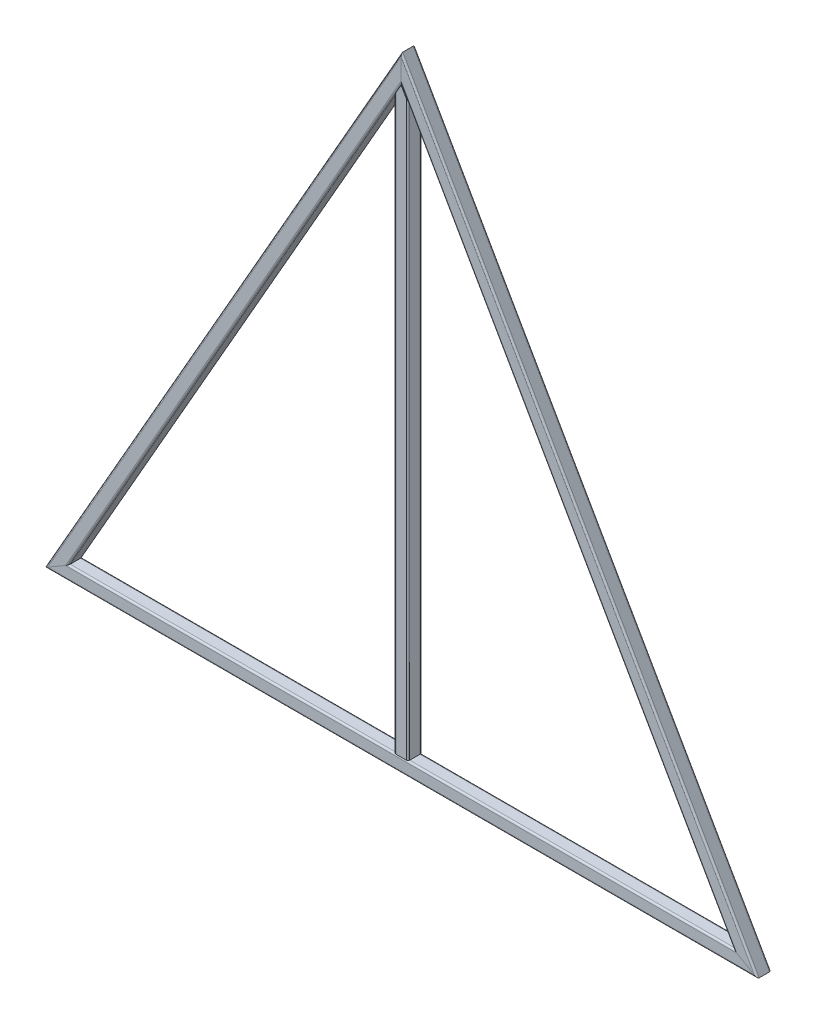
ISO-10303-21;
HEADER;
FILE_DESCRIPTION(('STEP AP214'),'2;1');
FILE_NAME('part.step','',(''),(''),'','','');
FILE_SCHEMA(('AUTOMOTIVE_DESIGN { 1 0 10303 214 1 1 1 1 }'));
ENDSEC;
DATA;
#1=APPLICATION_CONTEXT('core data for automotive mechanical design processes');
#2=APPLICATION_PROTOCOL_DEFINITION('international standard','automotive_design',2000,#1);
#3=PRODUCT_CONTEXT('',#1,'mechanical');
#4=PRODUCT('Part','Part','',(#3));
#5=PRODUCT_RELATED_PRODUCT_CATEGORY('part','',(#4));
#6=PRODUCT_DEFINITION_FORMATION('','',#4);
#7=PRODUCT_DEFINITION_CONTEXT('part definition',#1,'design');
#8=PRODUCT_DEFINITION('design','',#6,#7);
#9=PRODUCT_DEFINITION_SHAPE('','',#8);
#10=(LENGTH_UNIT() NAMED_UNIT(*) SI_UNIT(.MILLI.,.METRE.));
#11=(NAMED_UNIT(*) PLANE_ANGLE_UNIT() SI_UNIT($,.RADIAN.));
#12=(NAMED_UNIT(*) SI_UNIT($,.STERADIAN.) SOLID_ANGLE_UNIT());
#13=UNCERTAINTY_MEASURE_WITH_UNIT(LENGTH_MEASURE(1.E-05),#10,'distance_accuracy_value','');
#14=(GEOMETRIC_REPRESENTATION_CONTEXT(3) GLOBAL_UNCERTAINTY_ASSIGNED_CONTEXT((#13)) GLOBAL_UNIT_ASSIGNED_CONTEXT((#10,
#11,#12)) REPRESENTATION_CONTEXT('',''));
#15=CARTESIAN_POINT('',(0.,0.,0.));
#16=DIRECTION('',(0.,0.,1.));
#17=DIRECTION('',(1.,0.,0.));
#18=AXIS2_PLACEMENT_3D('',#15,#16,#17);
#19=CARTESIAN_POINT('',(-26.0472942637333,3485.1158318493,30.));
#20=DIRECTION('',(0.496138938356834,-0.868243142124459,0.));
#21=DIRECTION('',(0.868243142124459,0.496138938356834,0.));
#22=AXIS2_PLACEMENT_3D('',#19,#20,#21);
#23=CYLINDRICAL_SURFACE('',#22,10.);
#24=CARTESIAN_POINT('',(1948.30460965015,29.9999999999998,30.));
#25=DIRECTION('',(-0.501926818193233,-0.864910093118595,0.));
#26=DIRECTION('',(0.864910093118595,-0.501926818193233,0.));
#27=AXIS2_PLACEMENT_3D('',#24,#25,#26);
#28=ELLIPSE('',#27,19.9232231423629,10.);
#29=CARTESIAN_POINT('',(1948.30460965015,30.0000000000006,40.));
#30=VERTEX_POINT('',#29);
#31=CARTESIAN_POINT('',(1931.07281286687,39.9999999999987,30.));
#32=VERTEX_POINT('',#31);
#33=EDGE_CURVE('E231',#30,#32,#28,.T.);
#34=ORIENTED_EDGE('',*,*,#33,.F.);
#35=DIRECTION('',(0.496138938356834,-0.868243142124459,0.));
#36=VECTOR('',#35,1.);
#37=CARTESIAN_POINT('',(-26.0472942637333,3485.1158318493,40.));
#38=LINE('',#37,#36);
#39=CARTESIAN_POINT('',(0.,3439.53306688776,40.));
#40=VERTEX_POINT('',#39);
#41=EDGE_CURVE('E329',#40,#30,#38,.T.);
#42=ORIENTED_EDGE('',*,*,#41,.F.);
#43=CARTESIAN_POINT('',(0.,3439.53306688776,30.));
#44=DIRECTION('',(-1.,0.,0.));
#45=DIRECTION('',(0.,-1.,0.));
#46=AXIS2_PLACEMENT_3D('',#43,#44,#45);
#47=ELLIPSE('',#46,20.1556443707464,10.);
#48=CARTESIAN_POINT('',(0.,3419.37742251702,30.));
#49=VERTEX_POINT('',#48);
#50=EDGE_CURVE('E222',#49,#40,#47,.T.);
#51=ORIENTED_EDGE('',*,*,#50,.F.);
#52=DIRECTION('',(0.496138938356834,-0.868243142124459,0.));
#53=VECTOR('',#52,1.);
#54=CARTESIAN_POINT('',(-34.7297256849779,3480.15444246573,30.));
#55=LINE('',#54,#53);
#56=EDGE_CURVE('E90',#49,#32,#55,.T.);
#57=ORIENTED_EDGE('',*,*,#56,.T.);
#58=EDGE_LOOP('',(#34,#42,#51,#57));
#59=FACE_BOUND('',#58,.T.);
#60=ADVANCED_FACE('F86',(#59),#23,.T.);
#61=CARTESIAN_POINT('',(-26.0472942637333,3485.1158318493,40.));
#62=DIRECTION('',(0.,0.,-1.));
#63=DIRECTION('',(-1.,0.,0.));
#64=AXIS2_PLACEMENT_3D('',#61,#62,#63);
#65=PLANE('',#64);
#66=DIRECTION('',(-0.864910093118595,0.501926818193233,0.));
#67=VECTOR('',#66,1.);
#68=CARTESIAN_POINT('',(-1028.5880842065,1757.55791592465,40.));
#69=LINE('',#68,#67);
#70=CARTESIAN_POINT('',(2051.69539034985,-29.9999999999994,39.9999999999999));
#71=VERTEX_POINT('',#70);
#72=EDGE_CURVE('E228',#71,#30,#69,.T.);
#73=ORIENTED_EDGE('',*,*,#72,.F.);
#74=DIRECTION('',(0.496138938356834,-0.868243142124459,0.));
#75=VECTOR('',#74,1.);
#76=CARTESIAN_POINT('',(26.0472942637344,3514.8841681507,39.9999999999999));
#77=LINE('',#76,#75);
#78=CARTESIAN_POINT('',(0.,3560.46693311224,39.9999999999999));
#79=VERTEX_POINT('',#78);
#80=EDGE_CURVE('E326',#79,#71,#77,.T.);
#81=ORIENTED_EDGE('',*,*,#80,.F.);
#82=DIRECTION('',(0.,1.,0.));
#83=VECTOR('',#82,1.);
#84=CARTESIAN_POINT('',(0.,3485.1158318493,40.));
#85=LINE('',#84,#83);
#86=EDGE_CURVE('E348',#40,#79,#85,.T.);
#87=ORIENTED_EDGE('',*,*,#86,.F.);
#88=ORIENTED_EDGE('',*,*,#41,.T.);
#89=EDGE_LOOP('',(#73,#81,#87,#88));
#90=FACE_BOUND('',#89,.T.);
#91=ADVANCED_FACE('F339',(#90),#65,.F.);
#92=CARTESIAN_POINT('',(26.0472942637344,3514.8841681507,30.));
#93=DIRECTION('',(0.496138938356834,-0.868243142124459,0.));
#94=DIRECTION('',(0.868243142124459,0.496138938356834,0.));
#95=AXIS2_PLACEMENT_3D('',#92,#93,#94);
#96=CYLINDRICAL_SURFACE('',#95,9.9999999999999);
#97=CARTESIAN_POINT('',(2051.69539034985,-30.0000000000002,30.));
#98=DIRECTION('',(-0.501926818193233,-0.864910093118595,0.));
#99=DIRECTION('',(0.864910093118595,-0.501926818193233,0.));
#100=AXIS2_PLACEMENT_3D('',#97,#98,#99);
#101=ELLIPSE('',#100,19.9232231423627,9.9999999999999);
#102=CARTESIAN_POINT('',(2068.92718713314,-40.0000000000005,30.));
#103=VERTEX_POINT('',#102);
#104=EDGE_CURVE('E14',#103,#71,#101,.T.);
#105=ORIENTED_EDGE('',*,*,#104,.F.);
#106=DIRECTION('',(0.496138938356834,-0.868243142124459,0.));
#107=VECTOR('',#106,1.);
#108=CARTESIAN_POINT('',(34.7297256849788,3519.84555753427,30.));
#109=LINE('',#108,#107);
#110=CARTESIAN_POINT('',(0.,3580.62257748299,30.));
#111=VERTEX_POINT('',#110);
#112=EDGE_CURVE('E321',#111,#103,#109,.T.);
#113=ORIENTED_EDGE('',*,*,#112,.F.);
#114=CARTESIAN_POINT('',(0.,3560.46693311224,30.));
#115=DIRECTION('',(-1.,0.,0.));
#116=DIRECTION('',(0.,-1.,0.));
#117=AXIS2_PLACEMENT_3D('',#114,#115,#116);
#118=ELLIPSE('',#117,20.1556443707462,9.9999999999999);
#119=EDGE_CURVE('E345',#79,#111,#118,.T.);
#120=ORIENTED_EDGE('',*,*,#119,.F.);
#121=ORIENTED_EDGE('',*,*,#80,.T.);
#122=EDGE_LOOP('',(#105,#113,#120,#121));
#123=FACE_BOUND('',#122,.T.);
#124=ADVANCED_FACE('F342',(#123),#96,.T.);
#125=CARTESIAN_POINT('',(34.7297256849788,3519.84555753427,-30.));
#126=DIRECTION('',(-0.868243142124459,-0.496138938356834,0.));
#127=DIRECTION('',(0.496138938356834,-0.868243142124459,0.));
#128=AXIS2_PLACEMENT_3D('',#125,#126,#127);
#129=PLANE('',#128);
#130=DIRECTION('',(0.,0.,1.));
#131=VECTOR('',#130,1.);
#132=CARTESIAN_POINT('',(2068.92718713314,-40.,-30.));
#133=LINE('',#132,#131);
#134=CARTESIAN_POINT('',(2068.92718713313,-40.,-30.));
#135=VERTEX_POINT('',#134);
#136=EDGE_CURVE('E96',#135,#103,#133,.T.);
#137=ORIENTED_EDGE('',*,*,#136,.F.);
#138=DIRECTION('',(0.496138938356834,-0.868243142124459,0.));
#139=VECTOR('',#138,1.);
#140=CARTESIAN_POINT('',(34.7297256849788,3519.84555753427,-30.));
#141=LINE('',#140,#139);
#142=CARTESIAN_POINT('',(0.,3580.62257748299,-30.));
#143=VERTEX_POINT('',#142);
#144=EDGE_CURVE('E316',#143,#135,#141,.T.);
#145=ORIENTED_EDGE('',*,*,#144,.F.);
#146=DIRECTION('',(0.,0.,-1.));
#147=VECTOR('',#146,1.);
#148=CARTESIAN_POINT('',(0.,3580.62257748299,-30.));
#149=LINE('',#148,#147);
#150=EDGE_CURVE('E347',#111,#143,#149,.T.);
#151=ORIENTED_EDGE('',*,*,#150,.F.);
#152=ORIENTED_EDGE('',*,*,#112,.T.);
#153=EDGE_LOOP('',(#137,#145,#151,#152));
#154=FACE_BOUND('',#153,.T.);
#155=ADVANCED_FACE('F358',(#154),#129,.F.);
#156=CARTESIAN_POINT('',(26.0472942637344,3514.8841681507,-30.));
#157=DIRECTION('',(0.496138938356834,-0.868243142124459,0.));
#158=DIRECTION('',(0.868243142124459,0.496138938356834,0.));
#159=AXIS2_PLACEMENT_3D('',#156,#157,#158);
#160=CYLINDRICAL_SURFACE('',#159,9.9999999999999);
#161=CARTESIAN_POINT('',(2051.69539034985,-30.0000000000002,-30.));
#162=DIRECTION('',(-0.501926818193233,-0.864910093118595,0.));
#163=DIRECTION('',(0.864910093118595,-0.501926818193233,0.));
#164=AXIS2_PLACEMENT_3D('',#161,#162,#163);
#165=ELLIPSE('',#164,19.9232231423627,9.9999999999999);
#166=CARTESIAN_POINT('',(2051.69539034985,-29.9999999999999,-40.));
#167=VERTEX_POINT('',#166);
#168=EDGE_CURVE('E246',#167,#135,#165,.T.);
#169=ORIENTED_EDGE('',*,*,#168,.F.);
#170=DIRECTION('',(0.496138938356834,-0.868243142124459,0.));
#171=VECTOR('',#170,1.);
#172=CARTESIAN_POINT('',(26.0472942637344,3514.8841681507,-40.));
#173=LINE('',#172,#171);
#174=CARTESIAN_POINT('',(0.,3560.46693311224,-40.));
#175=VERTEX_POINT('',#174);
#176=EDGE_CURVE('E312',#175,#167,#173,.T.);
#177=ORIENTED_EDGE('',*,*,#176,.F.);
#178=CARTESIAN_POINT('',(0.,3560.46693311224,-30.));
#179=DIRECTION('',(-1.,0.,0.));
#180=DIRECTION('',(0.,-1.,0.));
#181=AXIS2_PLACEMENT_3D('',#178,#179,#180);
#182=ELLIPSE('',#181,20.1556443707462,9.9999999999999);
#183=EDGE_CURVE('E233',#143,#175,#182,.T.);
#184=ORIENTED_EDGE('',*,*,#183,.F.);
#185=ORIENTED_EDGE('',*,*,#144,.T.);
#186=EDGE_LOOP('',(#169,#177,#184,#185));
#187=FACE_BOUND('',#186,.T.);
#188=ADVANCED_FACE('F356',(#187),#160,.T.);
#189=CARTESIAN_POINT('',(26.0472942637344,3514.8841681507,-40.));
#190=DIRECTION('',(0.,0.,1.));
#191=DIRECTION('',(1.,0.,0.));
#192=AXIS2_PLACEMENT_3D('',#189,#190,#191);
#193=PLANE('',#192);
#194=DIRECTION('',(0.864910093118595,-0.501926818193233,0.));
#195=VECTOR('',#194,1.);
#196=CARTESIAN_POINT('',(-1002.54078994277,1742.44208407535,-40.));
#197=LINE('',#196,#195);
#198=CARTESIAN_POINT('',(1948.30460965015,29.9999999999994,-40.));
#199=VERTEX_POINT('',#198);
#200=EDGE_CURVE('E249',#199,#167,#197,.T.);
#201=ORIENTED_EDGE('',*,*,#200,.F.);
#202=DIRECTION('',(0.496138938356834,-0.868243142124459,0.));
#203=VECTOR('',#202,1.);
#204=CARTESIAN_POINT('',(-26.0472942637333,3485.1158318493,-40.));
#205=LINE('',#204,#203);
#206=CARTESIAN_POINT('',(0.,3439.53306688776,-40.));
#207=VERTEX_POINT('',#206);
#208=EDGE_CURVE('E309',#207,#199,#205,.T.);
#209=ORIENTED_EDGE('',*,*,#208,.F.);
#210=DIRECTION('',(0.,-1.,0.));
#211=VECTOR('',#210,1.);
#212=CARTESIAN_POINT('',(0.,3514.8841681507,-40.));
#213=LINE('',#212,#211);
#214=EDGE_CURVE('E227',#175,#207,#213,.T.);
#215=ORIENTED_EDGE('',*,*,#214,.F.);
#216=ORIENTED_EDGE('',*,*,#176,.T.);
#217=EDGE_LOOP('',(#201,#209,#215,#216));
#218=FACE_BOUND('',#217,.T.);
#219=ADVANCED_FACE('F360',(#218),#193,.F.);
#220=CARTESIAN_POINT('',(-26.0472942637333,3485.1158318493,-30.));
#221=DIRECTION('',(0.496138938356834,-0.868243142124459,0.));
#222=DIRECTION('',(0.868243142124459,0.496138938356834,0.));
#223=AXIS2_PLACEMENT_3D('',#220,#221,#222);
#224=CYLINDRICAL_SURFACE('',#223,10.);
#225=CARTESIAN_POINT('',(1948.30460965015,29.9999999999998,-30.));
#226=DIRECTION('',(-0.501926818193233,-0.864910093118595,0.));
#227=DIRECTION('',(0.864910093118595,-0.501926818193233,0.));
#228=AXIS2_PLACEMENT_3D('',#225,#226,#227);
#229=ELLIPSE('',#228,19.9232231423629,10.);
#230=CARTESIAN_POINT('',(1931.07281286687,39.9999999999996,-30.));
#231=VERTEX_POINT('',#230);
#232=EDGE_CURVE('E209',#231,#199,#229,.T.);
#233=ORIENTED_EDGE('',*,*,#232,.F.);
#234=DIRECTION('',(0.496138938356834,-0.868243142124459,0.));
#235=VECTOR('',#234,1.);
#236=CARTESIAN_POINT('',(-34.7297256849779,3480.15444246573,-30.));
#237=LINE('',#236,#235);
#238=CARTESIAN_POINT('',(0.,3419.37742251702,-30.));
#239=VERTEX_POINT('',#238);
#240=EDGE_CURVE('E201',#239,#231,#237,.T.);
#241=ORIENTED_EDGE('',*,*,#240,.F.);
#242=CARTESIAN_POINT('',(0.,3439.53306688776,-30.));
#243=DIRECTION('',(-1.,0.,0.));
#244=DIRECTION('',(0.,-1.,0.));
#245=AXIS2_PLACEMENT_3D('',#242,#243,#244);
#246=ELLIPSE('',#245,20.1556443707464,10.);
#247=EDGE_CURVE('E206',#207,#239,#246,.T.);
#248=ORIENTED_EDGE('',*,*,#247,.F.);
#249=ORIENTED_EDGE('',*,*,#208,.T.);
#250=EDGE_LOOP('',(#233,#241,#248,#249));
#251=FACE_BOUND('',#250,.T.);
#252=ADVANCED_FACE('F203',(#251),#224,.T.);
#253=CARTESIAN_POINT('',(26.0472942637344,3514.8841681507,30.));
#254=DIRECTION('',(0.496138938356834,-0.868243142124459,0.));
#255=DIRECTION('',(0.868243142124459,0.496138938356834,0.));
#256=AXIS2_PLACEMENT_3D('',#253,#254,#255);
#257=CYLINDRICAL_SURFACE('',#256,4.99999999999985);
#258=DIRECTION('',(0.496138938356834,-0.868243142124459,0.));
#259=VECTOR('',#258,1.);
#260=CARTESIAN_POINT('',(30.3885099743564,3517.36486284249,30.));
#261=LINE('',#260,#259);
#262=CARTESIAN_POINT('',(0.,3570.54475529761,30.));
#263=VERTEX_POINT('',#262);
#264=CARTESIAN_POINT('',(2060.31128874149,-35.0000000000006,30.));
#265=VERTEX_POINT('',#264);
#266=EDGE_CURVE('E255',#263,#265,#261,.T.);
#267=ORIENTED_EDGE('',*,*,#266,.T.);
#268=CARTESIAN_POINT('',(2051.69539034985,-30.0000000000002,30.));
#269=DIRECTION('',(-0.501926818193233,-0.864910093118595,0.));
#270=DIRECTION('',(0.864910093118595,-0.501926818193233,0.));
#271=AXIS2_PLACEMENT_3D('',#268,#269,#270);
#272=ELLIPSE('',#271,9.96161157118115,4.99999999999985);
#273=CARTESIAN_POINT('',(2051.69539034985,-29.9999999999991,35.));
#274=VERTEX_POINT('',#273);
#275=EDGE_CURVE('E132',#265,#274,#272,.T.);
#276=ORIENTED_EDGE('',*,*,#275,.T.);
#277=DIRECTION('',(0.496138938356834,-0.868243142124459,0.));
#278=VECTOR('',#277,1.);
#279=CARTESIAN_POINT('',(26.0472942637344,3514.8841681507,35.));
#280=LINE('',#279,#278);
#281=CARTESIAN_POINT('',(0.,3560.46693311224,35.));
#282=VERTEX_POINT('',#281);
#283=EDGE_CURVE('E258',#282,#274,#280,.T.);
#284=ORIENTED_EDGE('',*,*,#283,.F.);
#285=CARTESIAN_POINT('',(0.,3560.46693311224,30.));
#286=DIRECTION('',(-1.,0.,0.));
#287=DIRECTION('',(0.,-1.,0.));
#288=AXIS2_PLACEMENT_3D('',#285,#286,#287);
#289=ELLIPSE('',#288,10.0778221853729,4.99999999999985);
#290=EDGE_CURVE('E254',#282,#263,#289,.T.);
#291=ORIENTED_EDGE('',*,*,#290,.T.);
#292=EDGE_LOOP('',(#267,#276,#284,#291));
#293=FACE_BOUND('',#292,.T.);
#294=ADVANCED_FACE('F367',(#293),#257,.F.);
#295=CARTESIAN_POINT('',(-26.0472942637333,3485.1158318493,35.));
#296=DIRECTION('',(0.,0.,-1.));
#297=DIRECTION('',(-1.,0.,0.));
#298=AXIS2_PLACEMENT_3D('',#295,#296,#297);
#299=PLANE('',#298);
#300=ORIENTED_EDGE('',*,*,#283,.T.);
#301=DIRECTION('',(-0.864910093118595,0.501926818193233,0.));
#302=VECTOR('',#301,1.);
#303=CARTESIAN_POINT('',(-1028.5880842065,1757.55791592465,35.));
#304=LINE('',#303,#302);
#305=CARTESIAN_POINT('',(1948.30460965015,29.9999999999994,35.));
#306=VERTEX_POINT('',#305);
#307=EDGE_CURVE('E105',#274,#306,#304,.T.);
#308=ORIENTED_EDGE('',*,*,#307,.T.);
#309=DIRECTION('',(0.496138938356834,-0.868243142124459,0.));
#310=VECTOR('',#309,1.);
#311=CARTESIAN_POINT('',(-26.0472942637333,3485.1158318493,35.));
#312=LINE('',#311,#310);
#313=CARTESIAN_POINT('',(0.,3439.53306688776,35.));
#314=VERTEX_POINT('',#313);
#315=EDGE_CURVE('E263',#314,#306,#312,.T.);
#316=ORIENTED_EDGE('',*,*,#315,.F.);
#317=DIRECTION('',(0.,1.,0.));
#318=VECTOR('',#317,1.);
#319=CARTESIAN_POINT('',(0.,3485.1158318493,35.));
#320=LINE('',#319,#318);
#321=EDGE_CURVE('E257',#314,#282,#320,.T.);
#322=ORIENTED_EDGE('',*,*,#321,.T.);
#323=EDGE_LOOP('',(#300,#308,#316,#322));
#324=FACE_BOUND('',#323,.T.);
#325=ADVANCED_FACE('F409',(#324),#299,.T.);
#326=CARTESIAN_POINT('',(-26.0472942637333,3485.1158318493,30.));
#327=DIRECTION('',(0.496138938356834,-0.868243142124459,0.));
#328=DIRECTION('',(0.868243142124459,0.496138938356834,0.));
#329=AXIS2_PLACEMENT_3D('',#326,#327,#328);
#330=CYLINDRICAL_SURFACE('',#329,5.00000000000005);
#331=ORIENTED_EDGE('',*,*,#315,.T.);
#332=CARTESIAN_POINT('',(1948.30460965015,29.9999999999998,30.));
#333=DIRECTION('',(-0.501926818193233,-0.864910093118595,0.));
#334=DIRECTION('',(0.864910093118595,-0.501926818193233,0.));
#335=AXIS2_PLACEMENT_3D('',#332,#333,#334);
#336=ELLIPSE('',#335,9.96161157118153,5.00000000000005);
#337=CARTESIAN_POINT('',(1939.68871125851,35.0000000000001,30.));
#338=VERTEX_POINT('',#337);
#339=EDGE_CURVE('E259',#306,#338,#336,.T.);
#340=ORIENTED_EDGE('',*,*,#339,.T.);
#341=DIRECTION('',(0.496138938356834,-0.868243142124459,0.));
#342=VECTOR('',#341,1.);
#343=CARTESIAN_POINT('',(-30.3885099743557,3482.63513715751,30.));
#344=LINE('',#343,#342);
#345=CARTESIAN_POINT('',(0.,3429.45524470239,30.));
#346=VERTEX_POINT('',#345);
#347=EDGE_CURVE('E268',#346,#338,#344,.T.);
#348=ORIENTED_EDGE('',*,*,#347,.F.);
#349=CARTESIAN_POINT('',(0.,3439.53306688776,30.));
#350=DIRECTION('',(-1.,0.,0.));
#351=DIRECTION('',(0.,-1.,0.));
#352=AXIS2_PLACEMENT_3D('',#349,#350,#351);
#353=ELLIPSE('',#352,10.0778221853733,5.00000000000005);
#354=EDGE_CURVE('E262',#346,#314,#353,.T.);
#355=ORIENTED_EDGE('',*,*,#354,.T.);
#356=EDGE_LOOP('',(#331,#340,#348,#355));
#357=FACE_BOUND('',#356,.T.);
#358=ADVANCED_FACE('F420',(#357),#330,.F.);
#359=CARTESIAN_POINT('',(-30.3885099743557,3482.63513715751,30.));
#360=DIRECTION('',(0.868243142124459,0.496138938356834,0.));
#361=DIRECTION('',(-0.496138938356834,0.868243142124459,0.));
#362=AXIS2_PLACEMENT_3D('',#359,#360,#361);
#363=PLANE('',#362);
#364=ORIENTED_EDGE('',*,*,#347,.T.);
#365=DIRECTION('',(0.,0.,-1.));
#366=VECTOR('',#365,1.);
#367=CARTESIAN_POINT('',(1939.68871125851,35.0000000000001,30.));
#368=LINE('',#367,#366);
#369=CARTESIAN_POINT('',(1939.68871125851,35.0000000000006,-30.));
#370=VERTEX_POINT('',#369);
#371=EDGE_CURVE('E264',#338,#370,#368,.T.);
#372=ORIENTED_EDGE('',*,*,#371,.T.);
#373=DIRECTION('',(0.496138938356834,-0.868243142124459,0.));
#374=VECTOR('',#373,1.);
#375=CARTESIAN_POINT('',(-30.3885099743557,3482.63513715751,-30.));
#376=LINE('',#375,#374);
#377=CARTESIAN_POINT('',(0.,3429.45524470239,-30.));
#378=VERTEX_POINT('',#377);
#379=EDGE_CURVE('E273',#378,#370,#376,.T.);
#380=ORIENTED_EDGE('',*,*,#379,.F.);
#381=DIRECTION('',(0.,0.,1.));
#382=VECTOR('',#381,1.);
#383=CARTESIAN_POINT('',(0.,3429.45524470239,30.));
#384=LINE('',#383,#382);
#385=EDGE_CURVE('E267',#378,#346,#384,.T.);
#386=ORIENTED_EDGE('',*,*,#385,.T.);
#387=EDGE_LOOP('',(#364,#372,#380,#386));
#388=FACE_BOUND('',#387,.T.);
#389=ADVANCED_FACE('F431',(#388),#363,.T.);
#390=CARTESIAN_POINT('',(-26.0472942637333,3485.1158318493,-30.));
#391=DIRECTION('',(0.496138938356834,-0.868243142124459,0.));
#392=DIRECTION('',(0.868243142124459,0.496138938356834,0.));
#393=AXIS2_PLACEMENT_3D('',#390,#391,#392);
#394=CYLINDRICAL_SURFACE('',#393,5.00000000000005);
#395=ORIENTED_EDGE('',*,*,#379,.T.);
#396=CARTESIAN_POINT('',(1948.30460965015,29.9999999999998,-30.));
#397=DIRECTION('',(-0.501926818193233,-0.864910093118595,0.));
#398=DIRECTION('',(0.864910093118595,-0.501926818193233,0.));
#399=AXIS2_PLACEMENT_3D('',#396,#397,#398);
#400=ELLIPSE('',#399,9.96161157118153,5.00000000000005);
#401=CARTESIAN_POINT('',(1948.30460965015,29.9999999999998,-35.));
#402=VERTEX_POINT('',#401);
#403=EDGE_CURVE('E269',#370,#402,#400,.T.);
#404=ORIENTED_EDGE('',*,*,#403,.T.);
#405=DIRECTION('',(0.496138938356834,-0.868243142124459,0.));
#406=VECTOR('',#405,1.);
#407=CARTESIAN_POINT('',(-26.0472942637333,3485.1158318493,-35.));
#408=LINE('',#407,#406);
#409=CARTESIAN_POINT('',(0.,3439.53306688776,-35.));
#410=VERTEX_POINT('',#409);
#411=EDGE_CURVE('E278',#410,#402,#408,.T.);
#412=ORIENTED_EDGE('',*,*,#411,.F.);
#413=CARTESIAN_POINT('',(0.,3439.53306688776,-30.));
#414=DIRECTION('',(-1.,0.,0.));
#415=DIRECTION('',(0.,-1.,0.));
#416=AXIS2_PLACEMENT_3D('',#413,#414,#415);
#417=ELLIPSE('',#416,10.0778221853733,5.00000000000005);
#418=EDGE_CURVE('E272',#410,#378,#417,.T.);
#419=ORIENTED_EDGE('',*,*,#418,.T.);
#420=EDGE_LOOP('',(#395,#404,#412,#419));
#421=FACE_BOUND('',#420,.T.);
#422=ADVANCED_FACE('F442',(#421),#394,.F.);
#423=CARTESIAN_POINT('',(26.0472942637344,3514.8841681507,-35.));
#424=DIRECTION('',(0.,0.,1.));
#425=DIRECTION('',(1.,0.,0.));
#426=AXIS2_PLACEMENT_3D('',#423,#424,#425);
#427=PLANE('',#426);
#428=ORIENTED_EDGE('',*,*,#411,.T.);
#429=DIRECTION('',(0.864910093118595,-0.501926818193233,0.));
#430=VECTOR('',#429,1.);
#431=CARTESIAN_POINT('',(-1002.54078994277,1742.44208407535,-35.));
#432=LINE('',#431,#430);
#433=CARTESIAN_POINT('',(2051.69539034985,-29.9999999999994,-35.));
#434=VERTEX_POINT('',#433);
#435=EDGE_CURVE('E274',#402,#434,#432,.T.);
#436=ORIENTED_EDGE('',*,*,#435,.T.);
#437=DIRECTION('',(0.496138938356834,-0.868243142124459,0.));
#438=VECTOR('',#437,1.);
#439=CARTESIAN_POINT('',(26.0472942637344,3514.8841681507,-35.));
#440=LINE('',#439,#438);
#441=CARTESIAN_POINT('',(0.,3560.46693311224,-35.));
#442=VERTEX_POINT('',#441);
#443=EDGE_CURVE('E282',#442,#434,#440,.T.);
#444=ORIENTED_EDGE('',*,*,#443,.F.);
#445=DIRECTION('',(0.,-1.,0.));
#446=VECTOR('',#445,1.);
#447=CARTESIAN_POINT('',(0.,3514.8841681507,-35.));
#448=LINE('',#447,#446);
#449=EDGE_CURVE('E277',#442,#410,#448,.T.);
#450=ORIENTED_EDGE('',*,*,#449,.T.);
#451=EDGE_LOOP('',(#428,#436,#444,#450));
#452=FACE_BOUND('',#451,.T.);
#453=ADVANCED_FACE('F453',(#452),#427,.T.);
#454=CARTESIAN_POINT('',(26.0472942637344,3514.8841681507,-30.));
#455=DIRECTION('',(0.496138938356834,-0.868243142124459,0.));
#456=DIRECTION('',(0.868243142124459,0.496138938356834,0.));
#457=AXIS2_PLACEMENT_3D('',#454,#455,#456);
#458=CYLINDRICAL_SURFACE('',#457,4.99999999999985);
#459=ORIENTED_EDGE('',*,*,#443,.T.);
#460=CARTESIAN_POINT('',(2051.69539034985,-30.0000000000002,-30.));
#461=DIRECTION('',(-0.501926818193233,-0.864910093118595,0.));
#462=DIRECTION('',(0.864910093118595,-0.501926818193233,0.));
#463=AXIS2_PLACEMENT_3D('',#460,#461,#462);
#464=ELLIPSE('',#463,9.96161157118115,4.99999999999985);
#465=CARTESIAN_POINT('',(2060.31128874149,-35.0000000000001,-30.));
#466=VERTEX_POINT('',#465);
#467=EDGE_CURVE('E279',#434,#466,#464,.T.);
#468=ORIENTED_EDGE('',*,*,#467,.T.);
#469=DIRECTION('',(0.496138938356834,-0.868243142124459,0.));
#470=VECTOR('',#469,1.);
#471=CARTESIAN_POINT('',(30.3885099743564,3517.36486284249,-30.));
#472=LINE('',#471,#470);
#473=CARTESIAN_POINT('',(0.,3570.54475529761,-30.));
#474=VERTEX_POINT('',#473);
#475=EDGE_CURVE('E240',#474,#466,#472,.T.);
#476=ORIENTED_EDGE('',*,*,#475,.F.);
#477=CARTESIAN_POINT('',(0.,3560.46693311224,-30.));
#478=DIRECTION('',(-1.,0.,0.));
#479=DIRECTION('',(0.,-1.,0.));
#480=AXIS2_PLACEMENT_3D('',#477,#478,#479);
#481=ELLIPSE('',#480,10.0778221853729,4.99999999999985);
#482=EDGE_CURVE('E281',#474,#442,#481,.T.);
#483=ORIENTED_EDGE('',*,*,#482,.T.);
#484=EDGE_LOOP('',(#459,#468,#476,#483));
#485=FACE_BOUND('',#484,.T.);
#486=ADVANCED_FACE('F464',(#485),#458,.F.);
#487=CARTESIAN_POINT('',(30.3885099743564,3517.36486284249,-30.));
#488=DIRECTION('',(-0.868243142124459,-0.496138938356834,0.));
#489=DIRECTION('',(0.496138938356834,-0.868243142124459,0.));
#490=AXIS2_PLACEMENT_3D('',#487,#488,#489);
#491=PLANE('',#490);
#492=ORIENTED_EDGE('',*,*,#475,.T.);
#493=DIRECTION('',(0.,0.,1.));
#494=VECTOR('',#493,1.);
#495=CARTESIAN_POINT('',(2060.31128874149,-35.0000000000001,-30.));
#496=LINE('',#495,#494);
#497=EDGE_CURVE('E127',#466,#265,#496,.T.);
#498=ORIENTED_EDGE('',*,*,#497,.T.);
#499=ORIENTED_EDGE('',*,*,#266,.F.);
#500=DIRECTION('',(0.,0.,-1.));
#501=VECTOR('',#500,1.);
#502=CARTESIAN_POINT('',(0.,3570.54475529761,-30.));
#503=LINE('',#502,#501);
#504=EDGE_CURVE('E215',#263,#474,#503,.T.);
#505=ORIENTED_EDGE('',*,*,#504,.T.);
#506=EDGE_LOOP('',(#492,#498,#499,#505));
#507=FACE_BOUND('',#506,.T.);
#508=ADVANCED_FACE('F475',(#507),#491,.T.);
#509=CARTESIAN_POINT('',(-34.7297256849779,3480.15444246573,30.));
#510=DIRECTION('',(0.868243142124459,0.496138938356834,0.));
#511=DIRECTION('',(-0.496138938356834,0.868243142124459,0.));
#512=AXIS2_PLACEMENT_3D('',#509,#510,#511);
#513=PLANE('',#512);
#514=DIRECTION('',(0.,0.,-1.));
#515=VECTOR('',#514,1.);
#516=CARTESIAN_POINT('',(1931.07281286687,39.9999999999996,30.));
#517=LINE('',#516,#515);
#518=EDGE_CURVE('E242',#32,#231,#517,.T.);
#519=ORIENTED_EDGE('',*,*,#518,.F.);
#520=ORIENTED_EDGE('',*,*,#56,.F.);
#521=DIRECTION('',(0.,0.,1.));
#522=VECTOR('',#521,1.);
#523=CARTESIAN_POINT('',(0.,3419.37742251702,30.));
#524=LINE('',#523,#522);
#525=EDGE_CURVE('E214',#239,#49,#524,.T.);
#526=ORIENTED_EDGE('',*,*,#525,.F.);
#527=ORIENTED_EDGE('',*,*,#240,.T.);
#528=EDGE_LOOP('',(#519,#520,#526,#527));
#529=FACE_BOUND('',#528,.T.);
#530=ADVANCED_FACE('F218',(#529),#513,.F.);
#531=CARTESIAN_POINT('',(0.,3500.,0.));
#532=DIRECTION('',(-1.,0.,0.));
#533=DIRECTION('',(0.,-1.,0.));
#534=AXIS2_PLACEMENT_3D('',#531,#532,#533);
#535=PLANE('',#534);
#536=ORIENTED_EDGE('',*,*,#290,.F.);
#537=ORIENTED_EDGE('',*,*,#321,.F.);
#538=ORIENTED_EDGE('',*,*,#354,.F.);
#539=ORIENTED_EDGE('',*,*,#385,.F.);
#540=ORIENTED_EDGE('',*,*,#418,.F.);
#541=ORIENTED_EDGE('',*,*,#449,.F.);
#542=ORIENTED_EDGE('',*,*,#482,.F.);
#543=ORIENTED_EDGE('',*,*,#504,.F.);
#544=EDGE_LOOP('',(#536,#537,#538,#539,#540,#541,#542,#543));
#545=FACE_BOUND('',#544,.T.);
#546=ORIENTED_EDGE('',*,*,#525,.T.);
#547=ORIENTED_EDGE('',*,*,#50,.T.);
#548=ORIENTED_EDGE('',*,*,#86,.T.);
#549=ORIENTED_EDGE('',*,*,#119,.T.);
#550=ORIENTED_EDGE('',*,*,#150,.T.);
#551=ORIENTED_EDGE('',*,*,#183,.T.);
#552=ORIENTED_EDGE('',*,*,#214,.T.);
#553=ORIENTED_EDGE('',*,*,#247,.T.);
#554=EDGE_LOOP('',(#546,#547,#548,#549,#550,#551,#552,#553));
#555=FACE_BOUND('',#554,.T.);
#556=ADVANCED_FACE('F225',(#545,#555),#535,.T.);
#557=CARTESIAN_POINT('',(2000.,0.,0.));
#558=DIRECTION('',(-0.501926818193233,-0.864910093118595,0.));
#559=DIRECTION('',(0.864910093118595,-0.501926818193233,0.));
#560=AXIS2_PLACEMENT_3D('',#557,#558,#559);
#561=PLANE('',#560);
#562=ORIENTED_EDGE('',*,*,#275,.F.);
#563=ORIENTED_EDGE('',*,*,#497,.F.);
#564=ORIENTED_EDGE('',*,*,#467,.F.);
#565=ORIENTED_EDGE('',*,*,#435,.F.);
#566=ORIENTED_EDGE('',*,*,#403,.F.);
#567=ORIENTED_EDGE('',*,*,#371,.F.);
#568=ORIENTED_EDGE('',*,*,#339,.F.);
#569=ORIENTED_EDGE('',*,*,#307,.F.);
#570=EDGE_LOOP('',(#562,#563,#564,#565,#566,#567,#568,#569));
#571=FACE_BOUND('',#570,.T.);
#572=ORIENTED_EDGE('',*,*,#72,.T.);
#573=ORIENTED_EDGE('',*,*,#33,.T.);
#574=ORIENTED_EDGE('',*,*,#518,.T.);
#575=ORIENTED_EDGE('',*,*,#232,.T.);
#576=ORIENTED_EDGE('',*,*,#200,.T.);
#577=ORIENTED_EDGE('',*,*,#168,.T.);
#578=ORIENTED_EDGE('',*,*,#136,.T.);
#579=ORIENTED_EDGE('',*,*,#104,.T.);
#580=EDGE_LOOP('',(#572,#573,#574,#575,#576,#577,#578,#579));
#581=FACE_BOUND('',#580,.T.);
#582=ADVANCED_FACE('F88',(#571,#581),#561,.T.);
#583=CLOSED_SHELL('',(#60,#91,#124,#155,#188,#219,#252,#294,#325,#358,#389,#422,#453,#486,#508,
#530,#556,#582));
#584=MANIFOLD_SOLID_BREP('B2',#583);
#585=CARTESIAN_POINT('',(2000.,29.9999999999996,30.));
#586=DIRECTION('',(-1.,0.,0.));
#587=DIRECTION('',(0.,0.,1.));
#588=AXIS2_PLACEMENT_3D('',#585,#586,#587);
#589=CYLINDRICAL_SURFACE('',#588,10.);
#590=CARTESIAN_POINT('',(1948.30460965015,29.9999999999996,30.));
#591=DIRECTION('',(0.501926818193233,0.864910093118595,0.));
#592=DIRECTION('',(-0.864910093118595,0.501926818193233,0.));
#593=AXIS2_PLACEMENT_3D('',#590,#591,#592);
#594=ELLIPSE('',#593,19.9232231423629,10.);
#595=CARTESIAN_POINT('',(1931.07281286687,39.9999999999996,30.));
#596=VERTEX_POINT('',#595);
#597=CARTESIAN_POINT('',(1948.30460965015,29.9999999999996,40.));
#598=VERTEX_POINT('',#597);
#599=EDGE_CURVE('E756',#596,#598,#594,.T.);
#600=ORIENTED_EDGE('',*,*,#599,.F.);
#601=DIRECTION('',(-1.,0.,0.));
#602=VECTOR('',#601,1.);
#603=CARTESIAN_POINT('',(2000.,39.9999999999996,30.));
#604=LINE('',#603,#602);
#605=CARTESIAN_POINT('',(-1931.07281286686,39.9999999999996,30.));
#606=VERTEX_POINT('',#605);
#607=EDGE_CURVE('E617',#596,#606,#604,.T.);
#608=ORIENTED_EDGE('',*,*,#607,.T.);
#609=CARTESIAN_POINT('',(-1948.30460965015,29.9999999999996,30.));
#610=DIRECTION('',(-0.501926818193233,0.864910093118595,0.));
#611=DIRECTION('',(-0.864910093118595,-0.501926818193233,0.));
#612=AXIS2_PLACEMENT_3D('',#609,#610,#611);
#613=ELLIPSE('',#612,19.9232231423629,10.);
#614=CARTESIAN_POINT('',(-1948.30460965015,29.9999999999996,40.));
#615=VERTEX_POINT('',#614);
#616=EDGE_CURVE('E852',#615,#606,#613,.T.);
#617=ORIENTED_EDGE('',*,*,#616,.F.);
#618=DIRECTION('',(-1.,0.,0.));
#619=VECTOR('',#618,1.);
#620=CARTESIAN_POINT('',(2000.,29.9999999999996,40.));
#621=LINE('',#620,#619);
#622=EDGE_CURVE('E843',#598,#615,#621,.T.);
#623=ORIENTED_EDGE('',*,*,#622,.F.);
#624=EDGE_LOOP('',(#600,#608,#617,#623));
#625=FACE_BOUND('',#624,.T.);
#626=ADVANCED_FACE('F613',(#625),#589,.T.);
#627=CARTESIAN_POINT('',(2000.,29.9999999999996,40.));
#628=DIRECTION('',(0.,0.,-1.));
#629=DIRECTION('',(-1.,0.,0.));
#630=AXIS2_PLACEMENT_3D('',#627,#628,#629);
#631=PLANE('',#630);
#632=DIRECTION('',(0.864910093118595,-0.501926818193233,0.));
#633=VECTOR('',#632,1.);
#634=CARTESIAN_POINT('',(1986.97635286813,7.55791592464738,40.));
#635=LINE('',#634,#633);
#636=CARTESIAN_POINT('',(2051.69539034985,-30.0000000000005,39.9999999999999));
#637=VERTEX_POINT('',#636);
#638=EDGE_CURVE('E774',#598,#637,#635,.T.);
#639=ORIENTED_EDGE('',*,*,#638,.F.);
#640=ORIENTED_EDGE('',*,*,#622,.T.);
#641=DIRECTION('',(0.864910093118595,0.501926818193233,0.));
#642=VECTOR('',#641,1.);
#643=CARTESIAN_POINT('',(1005.30152384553,1744.04420017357,40.));
#644=LINE('',#643,#642);
#645=CARTESIAN_POINT('',(-2051.69539034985,-30.0000000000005,39.9999999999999));
#646=VERTEX_POINT('',#645);
#647=EDGE_CURVE('E746',#646,#615,#644,.T.);
#648=ORIENTED_EDGE('',*,*,#647,.F.);
#649=DIRECTION('',(-1.,0.,0.));
#650=VECTOR('',#649,1.);
#651=CARTESIAN_POINT('',(2000.,-30.0000000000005,39.9999999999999));
#652=LINE('',#651,#650);
#653=EDGE_CURVE('E841',#637,#646,#652,.T.);
#654=ORIENTED_EDGE('',*,*,#653,.F.);
#655=EDGE_LOOP('',(#639,#640,#648,#654));
#656=FACE_BOUND('',#655,.T.);
#657=ADVANCED_FACE('F915',(#656),#631,.F.);
#658=CARTESIAN_POINT('',(2000.,-30.0000000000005,30.));
#659=DIRECTION('',(-1.,0.,0.));
#660=DIRECTION('',(0.,0.,1.));
#661=AXIS2_PLACEMENT_3D('',#658,#659,#660);
#662=CYLINDRICAL_SURFACE('',#661,9.9999999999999);
#663=CARTESIAN_POINT('',(2051.69539034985,-30.0000000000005,30.));
#664=DIRECTION('',(0.501926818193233,0.864910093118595,0.));
#665=DIRECTION('',(-0.864910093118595,0.501926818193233,0.));
#666=AXIS2_PLACEMENT_3D('',#663,#664,#665);
#667=ELLIPSE('',#666,19.9232231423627,9.9999999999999);
#668=CARTESIAN_POINT('',(2068.92718713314,-40.0000000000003,30.));
#669=VERTEX_POINT('',#668);
#670=EDGE_CURVE('E771',#637,#669,#667,.T.);
#671=ORIENTED_EDGE('',*,*,#670,.F.);
#672=ORIENTED_EDGE('',*,*,#653,.T.);
#673=CARTESIAN_POINT('',(-2051.69539034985,-30.0000000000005,30.));
#674=DIRECTION('',(-0.501926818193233,0.864910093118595,0.));
#675=DIRECTION('',(-0.864910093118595,-0.501926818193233,0.));
#676=AXIS2_PLACEMENT_3D('',#673,#674,#675);
#677=ELLIPSE('',#676,19.9232231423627,9.9999999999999);
#678=CARTESIAN_POINT('',(-2068.92718713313,-40.0000000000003,30.));
#679=VERTEX_POINT('',#678);
#680=EDGE_CURVE('E757',#679,#646,#677,.T.);
#681=ORIENTED_EDGE('',*,*,#680,.F.);
#682=DIRECTION('',(-1.,0.,0.));
#683=VECTOR('',#682,1.);
#684=CARTESIAN_POINT('',(2000.,-40.0000000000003,30.));
#685=LINE('',#684,#683);
#686=EDGE_CURVE('E838',#669,#679,#685,.T.);
#687=ORIENTED_EDGE('',*,*,#686,.F.);
#688=EDGE_LOOP('',(#671,#672,#681,#687));
#689=FACE_BOUND('',#688,.T.);
#690=ADVANCED_FACE('F913',(#689),#662,.T.);
#691=CARTESIAN_POINT('',(2000.,-40.0000000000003,-30.));
#692=DIRECTION('',(0.,1.,0.));
#693=DIRECTION('',(0.,0.,1.));
#694=AXIS2_PLACEMENT_3D('',#691,#692,#693);
#695=PLANE('',#694);
#696=DIRECTION('',(0.,0.,-1.));
#697=VECTOR('',#696,1.);
#698=CARTESIAN_POINT('',(2068.92718713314,-40.0000000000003,-30.));
#699=LINE('',#698,#697);
#700=CARTESIAN_POINT('',(2068.92718713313,-40.0000000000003,-30.));
#701=VERTEX_POINT('',#700);
#702=EDGE_CURVE('E766',#669,#701,#699,.T.);
#703=ORIENTED_EDGE('',*,*,#702,.F.);
#704=ORIENTED_EDGE('',*,*,#686,.T.);
#705=DIRECTION('',(0.,0.,1.));
#706=VECTOR('',#705,1.);
#707=CARTESIAN_POINT('',(-2068.92718713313,-40.0000000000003,-30.));
#708=LINE('',#707,#706);
#709=CARTESIAN_POINT('',(-2068.92718713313,-40.0000000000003,-30.));
#710=VERTEX_POINT('',#709);
#711=EDGE_CURVE('E906',#710,#679,#708,.T.);
#712=ORIENTED_EDGE('',*,*,#711,.F.);
#713=DIRECTION('',(-1.,0.,0.));
#714=VECTOR('',#713,1.);
#715=CARTESIAN_POINT('',(2000.,-40.0000000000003,-30.));
#716=LINE('',#715,#714);
#717=EDGE_CURVE('E835',#701,#710,#716,.T.);
#718=ORIENTED_EDGE('',*,*,#717,.F.);
#719=EDGE_LOOP('',(#703,#704,#712,#718));
#720=FACE_BOUND('',#719,.T.);
#721=ADVANCED_FACE('F922',(#720),#695,.F.);
#722=CARTESIAN_POINT('',(2000.,-30.0000000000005,-30.));
#723=DIRECTION('',(-1.,0.,0.));
#724=DIRECTION('',(0.,0.,1.));
#725=AXIS2_PLACEMENT_3D('',#722,#723,#724);
#726=CYLINDRICAL_SURFACE('',#725,9.9999999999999);
#727=CARTESIAN_POINT('',(2051.69539034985,-30.0000000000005,-30.));
#728=DIRECTION('',(0.501926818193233,0.864910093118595,0.));
#729=DIRECTION('',(-0.864910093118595,0.501926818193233,0.));
#730=AXIS2_PLACEMENT_3D('',#727,#728,#729);
#731=ELLIPSE('',#730,19.9232231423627,9.9999999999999);
#732=CARTESIAN_POINT('',(2051.69539034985,-30.0000000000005,-40.));
#733=VERTEX_POINT('',#732);
#734=EDGE_CURVE('E762',#701,#733,#731,.T.);
#735=ORIENTED_EDGE('',*,*,#734,.F.);
#736=ORIENTED_EDGE('',*,*,#717,.T.);
#737=CARTESIAN_POINT('',(-2051.69539034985,-30.0000000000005,-30.));
#738=DIRECTION('',(-0.501926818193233,0.864910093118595,0.));
#739=DIRECTION('',(-0.864910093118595,-0.501926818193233,0.));
#740=AXIS2_PLACEMENT_3D('',#737,#738,#739);
#741=ELLIPSE('',#740,19.9232231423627,9.9999999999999);
#742=CARTESIAN_POINT('',(-2051.69539034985,-30.0000000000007,-40.));
#743=VERTEX_POINT('',#742);
#744=EDGE_CURVE('E902',#743,#710,#741,.T.);
#745=ORIENTED_EDGE('',*,*,#744,.F.);
#746=DIRECTION('',(-1.,0.,0.));
#747=VECTOR('',#746,1.);
#748=CARTESIAN_POINT('',(2000.,-30.0000000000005,-40.));
#749=LINE('',#748,#747);
#750=EDGE_CURVE('E832',#733,#743,#749,.T.);
#751=ORIENTED_EDGE('',*,*,#750,.F.);
#752=EDGE_LOOP('',(#735,#736,#745,#751));
#753=FACE_BOUND('',#752,.T.);
#754=ADVANCED_FACE('F927',(#753),#726,.T.);
#755=CARTESIAN_POINT('',(2000.,-30.0000000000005,-40.));
#756=DIRECTION('',(0.,0.,1.));
#757=DIRECTION('',(1.,0.,0.));
#758=AXIS2_PLACEMENT_3D('',#755,#756,#757);
#759=PLANE('',#758);
#760=DIRECTION('',(-0.864910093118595,0.501926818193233,0.));
#761=VECTOR('',#760,1.);
#762=CARTESIAN_POINT('',(2013.02364713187,-7.55791592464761,-40.));
#763=LINE('',#762,#761);
#764=CARTESIAN_POINT('',(1948.30460965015,29.9999999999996,-40.));
#765=VERTEX_POINT('',#764);
#766=EDGE_CURVE('E623',#733,#765,#763,.T.);
#767=ORIENTED_EDGE('',*,*,#766,.F.);
#768=ORIENTED_EDGE('',*,*,#750,.T.);
#769=DIRECTION('',(-0.864910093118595,-0.501926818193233,0.));
#770=VECTOR('',#769,1.);
#771=CARTESIAN_POINT('',(979.2542295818,1728.92836832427,-40.));
#772=LINE('',#771,#770);
#773=CARTESIAN_POINT('',(-1948.30460965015,29.9999999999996,-40.));
#774=VERTEX_POINT('',#773);
#775=EDGE_CURVE('E898',#774,#743,#772,.T.);
#776=ORIENTED_EDGE('',*,*,#775,.F.);
#777=DIRECTION('',(-1.,0.,0.));
#778=VECTOR('',#777,1.);
#779=CARTESIAN_POINT('',(2000.,29.9999999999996,-40.));
#780=LINE('',#779,#778);
#781=EDGE_CURVE('E781',#765,#774,#780,.T.);
#782=ORIENTED_EDGE('',*,*,#781,.F.);
#783=EDGE_LOOP('',(#767,#768,#776,#782));
#784=FACE_BOUND('',#783,.T.);
#785=ADVANCED_FACE('F931',(#784),#759,.F.);
#786=CARTESIAN_POINT('',(2000.,29.9999999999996,-30.));
#787=DIRECTION('',(-1.,0.,0.));
#788=DIRECTION('',(0.,0.,1.));
#789=AXIS2_PLACEMENT_3D('',#786,#787,#788);
#790=CYLINDRICAL_SURFACE('',#789,10.);
#791=CARTESIAN_POINT('',(1948.30460965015,29.9999999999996,-30.));
#792=DIRECTION('',(0.501926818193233,0.864910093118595,0.));
#793=DIRECTION('',(-0.864910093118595,0.501926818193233,0.));
#794=AXIS2_PLACEMENT_3D('',#791,#792,#793);
#795=ELLIPSE('',#794,19.9232231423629,10.);
#796=CARTESIAN_POINT('',(1931.07281286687,39.9999999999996,-30.));
#797=VERTEX_POINT('',#796);
#798=EDGE_CURVE('E84',#765,#797,#795,.T.);
#799=ORIENTED_EDGE('',*,*,#798,.F.);
#800=ORIENTED_EDGE('',*,*,#781,.T.);
#801=CARTESIAN_POINT('',(-1948.30460965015,29.9999999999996,-30.));
#802=DIRECTION('',(-0.501926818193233,0.864910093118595,0.));
#803=DIRECTION('',(-0.864910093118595,-0.501926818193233,0.));
#804=AXIS2_PLACEMENT_3D('',#801,#802,#803);
#805=ELLIPSE('',#804,19.9232231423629,10.);
#806=CARTESIAN_POINT('',(-1931.07281286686,39.9999999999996,-30.));
#807=VERTEX_POINT('',#806);
#808=EDGE_CURVE('E741',#807,#774,#805,.T.);
#809=ORIENTED_EDGE('',*,*,#808,.F.);
#810=DIRECTION('',(-1.,0.,0.));
#811=VECTOR('',#810,1.);
#812=CARTESIAN_POINT('',(2000.,39.9999999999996,-30.));
#813=LINE('',#812,#811);
#814=EDGE_CURVE('E736',#797,#807,#813,.T.);
#815=ORIENTED_EDGE('',*,*,#814,.F.);
#816=EDGE_LOOP('',(#799,#800,#809,#815));
#817=FACE_BOUND('',#816,.T.);
#818=ADVANCED_FACE('F738',(#817),#790,.T.);
#819=CARTESIAN_POINT('',(2000.,-30.0000000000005,30.));
#820=DIRECTION('',(-1.,0.,0.));
#821=DIRECTION('',(0.,0.,1.));
#822=AXIS2_PLACEMENT_3D('',#819,#820,#821);
#823=CYLINDRICAL_SURFACE('',#822,4.99999999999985);
#824=DIRECTION('',(-1.,0.,0.));
#825=VECTOR('',#824,1.);
#826=CARTESIAN_POINT('',(2000.,-30.0000000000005,35.));
#827=LINE('',#826,#825);
#828=CARTESIAN_POINT('',(2051.69539034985,-30.0000000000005,35.));
#829=VERTEX_POINT('',#828);
#830=CARTESIAN_POINT('',(-2051.69539034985,-30.0000000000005,35.));
#831=VERTEX_POINT('',#830);
#832=EDGE_CURVE('E785',#829,#831,#827,.T.);
#833=ORIENTED_EDGE('',*,*,#832,.F.);
#834=CARTESIAN_POINT('',(2051.69539034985,-30.0000000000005,30.));
#835=DIRECTION('',(0.501926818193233,0.864910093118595,0.));
#836=DIRECTION('',(-0.864910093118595,0.501926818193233,0.));
#837=AXIS2_PLACEMENT_3D('',#834,#835,#836);
#838=ELLIPSE('',#837,9.96161157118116,4.99999999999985);
#839=CARTESIAN_POINT('',(2060.31128874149,-35.0000000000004,30.));
#840=VERTEX_POINT('',#839);
#841=EDGE_CURVE('E778',#829,#840,#838,.T.);
#842=ORIENTED_EDGE('',*,*,#841,.T.);
#843=DIRECTION('',(-1.,0.,0.));
#844=VECTOR('',#843,1.);
#845=CARTESIAN_POINT('',(2000.,-35.0000000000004,30.));
#846=LINE('',#845,#844);
#847=CARTESIAN_POINT('',(-2060.31128874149,-35.0000000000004,30.));
#848=VERTEX_POINT('',#847);
#849=EDGE_CURVE('E780',#840,#848,#846,.T.);
#850=ORIENTED_EDGE('',*,*,#849,.T.);
#851=CARTESIAN_POINT('',(-2051.69539034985,-30.0000000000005,30.));
#852=DIRECTION('',(-0.501926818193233,0.864910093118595,0.));
#853=DIRECTION('',(-0.864910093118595,-0.501926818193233,0.));
#854=AXIS2_PLACEMENT_3D('',#851,#852,#853);
#855=ELLIPSE('',#854,9.96161157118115,4.99999999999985);
#856=EDGE_CURVE('E786',#848,#831,#855,.T.);
#857=ORIENTED_EDGE('',*,*,#856,.T.);
#858=EDGE_LOOP('',(#833,#842,#850,#857));
#859=FACE_BOUND('',#858,.T.);
#860=ADVANCED_FACE('F937',(#859),#823,.F.);
#861=CARTESIAN_POINT('',(2000.,29.9999999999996,35.));
#862=DIRECTION('',(0.,0.,-1.));
#863=DIRECTION('',(-1.,0.,0.));
#864=AXIS2_PLACEMENT_3D('',#861,#862,#863);
#865=PLANE('',#864);
#866=DIRECTION('',(-1.,0.,0.));
#867=VECTOR('',#866,1.);
#868=CARTESIAN_POINT('',(2000.,29.9999999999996,35.));
#869=LINE('',#868,#867);
#870=CARTESIAN_POINT('',(1948.30460965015,29.9999999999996,35.));
#871=VERTEX_POINT('',#870);
#872=CARTESIAN_POINT('',(-1948.30460965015,29.9999999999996,35.));
#873=VERTEX_POINT('',#872);
#874=EDGE_CURVE('E790',#871,#873,#869,.T.);
#875=ORIENTED_EDGE('',*,*,#874,.F.);
#876=DIRECTION('',(0.864910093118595,-0.501926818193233,0.));
#877=VECTOR('',#876,1.);
#878=CARTESIAN_POINT('',(1986.97635286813,7.55791592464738,35.));
#879=LINE('',#878,#877);
#880=EDGE_CURVE('E782',#871,#829,#879,.T.);
#881=ORIENTED_EDGE('',*,*,#880,.T.);
#882=ORIENTED_EDGE('',*,*,#832,.T.);
#883=DIRECTION('',(0.864910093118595,0.501926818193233,0.));
#884=VECTOR('',#883,1.);
#885=CARTESIAN_POINT('',(1005.30152384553,1744.04420017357,35.));
#886=LINE('',#885,#884);
#887=EDGE_CURVE('E791',#831,#873,#886,.T.);
#888=ORIENTED_EDGE('',*,*,#887,.T.);
#889=EDGE_LOOP('',(#875,#881,#882,#888));
#890=FACE_BOUND('',#889,.T.);
#891=ADVANCED_FACE('F943',(#890),#865,.T.);
#892=CARTESIAN_POINT('',(2000.,29.9999999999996,30.));
#893=DIRECTION('',(-1.,0.,0.));
#894=DIRECTION('',(0.,0.,1.));
#895=AXIS2_PLACEMENT_3D('',#892,#893,#894);
#896=CYLINDRICAL_SURFACE('',#895,5.00000000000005);
#897=DIRECTION('',(-1.,0.,0.));
#898=VECTOR('',#897,1.);
#899=CARTESIAN_POINT('',(2000.,34.9999999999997,30.));
#900=LINE('',#899,#898);
#901=CARTESIAN_POINT('',(1939.68871125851,34.9999999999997,30.));
#902=VERTEX_POINT('',#901);
#903=CARTESIAN_POINT('',(-1939.68871125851,34.9999999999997,30.));
#904=VERTEX_POINT('',#903);
#905=EDGE_CURVE('E795',#902,#904,#900,.T.);
#906=ORIENTED_EDGE('',*,*,#905,.F.);
#907=CARTESIAN_POINT('',(1948.30460965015,29.9999999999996,30.));
#908=DIRECTION('',(0.501926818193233,0.864910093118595,0.));
#909=DIRECTION('',(-0.864910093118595,0.501926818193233,0.));
#910=AXIS2_PLACEMENT_3D('',#907,#908,#909);
#911=ELLIPSE('',#910,9.96161157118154,5.00000000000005);
#912=EDGE_CURVE('E787',#902,#871,#911,.T.);
#913=ORIENTED_EDGE('',*,*,#912,.T.);
#914=ORIENTED_EDGE('',*,*,#874,.T.);
#915=CARTESIAN_POINT('',(-1948.30460965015,29.9999999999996,30.));
#916=DIRECTION('',(-0.501926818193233,0.864910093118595,0.));
#917=DIRECTION('',(-0.864910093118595,-0.501926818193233,0.));
#918=AXIS2_PLACEMENT_3D('',#915,#916,#917);
#919=ELLIPSE('',#918,9.96161157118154,5.00000000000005);
#920=EDGE_CURVE('E796',#873,#904,#919,.T.);
#921=ORIENTED_EDGE('',*,*,#920,.T.);
#922=EDGE_LOOP('',(#906,#913,#914,#921));
#923=FACE_BOUND('',#922,.T.);
#924=ADVANCED_FACE('F947',(#923),#896,.F.);
#925=CARTESIAN_POINT('',(2000.,34.9999999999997,30.));
#926=DIRECTION('',(0.,-1.,0.));
#927=DIRECTION('',(0.,0.,-1.));
#928=AXIS2_PLACEMENT_3D('',#925,#926,#927);
#929=PLANE('',#928);
#930=DIRECTION('',(-1.,0.,0.));
#931=VECTOR('',#930,1.);
#932=CARTESIAN_POINT('',(2000.,34.9999999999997,-30.));
#933=LINE('',#932,#931);
#934=CARTESIAN_POINT('',(1939.68871125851,34.9999999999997,-30.));
#935=VERTEX_POINT('',#934);
#936=CARTESIAN_POINT('',(-1939.68871125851,34.9999999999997,-30.));
#937=VERTEX_POINT('',#936);
#938=EDGE_CURVE('E800',#935,#937,#933,.T.);
#939=ORIENTED_EDGE('',*,*,#938,.F.);
#940=DIRECTION('',(0.,0.,1.));
#941=VECTOR('',#940,1.);
#942=CARTESIAN_POINT('',(1939.68871125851,34.9999999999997,30.));
#943=LINE('',#942,#941);
#944=EDGE_CURVE('E792',#935,#902,#943,.T.);
#945=ORIENTED_EDGE('',*,*,#944,.T.);
#946=ORIENTED_EDGE('',*,*,#905,.T.);
#947=DIRECTION('',(0.,0.,-1.));
#948=VECTOR('',#947,1.);
#949=CARTESIAN_POINT('',(-1939.68871125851,34.9999999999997,30.));
#950=LINE('',#949,#948);
#951=EDGE_CURVE('E801',#904,#937,#950,.T.);
#952=ORIENTED_EDGE('',*,*,#951,.T.);
#953=EDGE_LOOP('',(#939,#945,#946,#952));
#954=FACE_BOUND('',#953,.T.);
#955=ADVANCED_FACE('F951',(#954),#929,.T.);
#956=CARTESIAN_POINT('',(2000.,29.9999999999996,-30.));
#957=DIRECTION('',(-1.,0.,0.));
#958=DIRECTION('',(0.,0.,1.));
#959=AXIS2_PLACEMENT_3D('',#956,#957,#958);
#960=CYLINDRICAL_SURFACE('',#959,5.00000000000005);
#961=DIRECTION('',(-1.,0.,0.));
#962=VECTOR('',#961,1.);
#963=CARTESIAN_POINT('',(2000.,29.9999999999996,-35.));
#964=LINE('',#963,#962);
#965=CARTESIAN_POINT('',(1948.30460965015,29.9999999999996,-35.));
#966=VERTEX_POINT('',#965);
#967=CARTESIAN_POINT('',(-1948.30460965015,29.9999999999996,-35.));
#968=VERTEX_POINT('',#967);
#969=EDGE_CURVE('E805',#966,#968,#964,.T.);
#970=ORIENTED_EDGE('',*,*,#969,.F.);
#971=CARTESIAN_POINT('',(1948.30460965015,29.9999999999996,-30.));
#972=DIRECTION('',(0.501926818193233,0.864910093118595,0.));
#973=DIRECTION('',(-0.864910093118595,0.501926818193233,0.));
#974=AXIS2_PLACEMENT_3D('',#971,#972,#973);
#975=ELLIPSE('',#974,9.96161157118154,5.00000000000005);
#976=EDGE_CURVE('E797',#966,#935,#975,.T.);
#977=ORIENTED_EDGE('',*,*,#976,.T.);
#978=ORIENTED_EDGE('',*,*,#938,.T.);
#979=CARTESIAN_POINT('',(-1948.30460965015,29.9999999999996,-30.));
#980=DIRECTION('',(-0.501926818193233,0.864910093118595,0.));
#981=DIRECTION('',(-0.864910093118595,-0.501926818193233,0.));
#982=AXIS2_PLACEMENT_3D('',#979,#980,#981);
#983=ELLIPSE('',#982,9.96161157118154,5.00000000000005);
#984=EDGE_CURVE('E806',#937,#968,#983,.T.);
#985=ORIENTED_EDGE('',*,*,#984,.T.);
#986=EDGE_LOOP('',(#970,#977,#978,#985));
#987=FACE_BOUND('',#986,.T.);
#988=ADVANCED_FACE('F955',(#987),#960,.F.);
#989=CARTESIAN_POINT('',(2000.,-30.0000000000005,-35.));
#990=DIRECTION('',(0.,0.,1.));
#991=DIRECTION('',(1.,0.,0.));
#992=AXIS2_PLACEMENT_3D('',#989,#990,#991);
#993=PLANE('',#992);
#994=DIRECTION('',(-1.,0.,0.));
#995=VECTOR('',#994,1.);
#996=CARTESIAN_POINT('',(2000.,-30.0000000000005,-35.));
#997=LINE('',#996,#995);
#998=CARTESIAN_POINT('',(2051.69539034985,-30.0000000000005,-35.));
#999=VERTEX_POINT('',#998);
#1000=CARTESIAN_POINT('',(-2051.69539034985,-30.0000000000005,-35.));
#1001=VERTEX_POINT('',#1000);
#1002=EDGE_CURVE('E809',#999,#1001,#997,.T.);
#1003=ORIENTED_EDGE('',*,*,#1002,.F.);
#1004=DIRECTION('',(-0.864910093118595,0.501926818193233,0.));
#1005=VECTOR('',#1004,1.);
#1006=CARTESIAN_POINT('',(2013.02364713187,-7.55791592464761,-35.));
#1007=LINE('',#1006,#1005);
#1008=EDGE_CURVE('E802',#999,#966,#1007,.T.);
#1009=ORIENTED_EDGE('',*,*,#1008,.T.);
#1010=ORIENTED_EDGE('',*,*,#969,.T.);
#1011=DIRECTION('',(-0.864910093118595,-0.501926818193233,0.));
#1012=VECTOR('',#1011,1.);
#1013=CARTESIAN_POINT('',(979.2542295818,1728.92836832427,-35.));
#1014=LINE('',#1013,#1012);
#1015=EDGE_CURVE('E810',#968,#1001,#1014,.T.);
#1016=ORIENTED_EDGE('',*,*,#1015,.T.);
#1017=EDGE_LOOP('',(#1003,#1009,#1010,#1016));
#1018=FACE_BOUND('',#1017,.T.);
#1019=ADVANCED_FACE('F959',(#1018),#993,.T.);
#1020=CARTESIAN_POINT('',(2000.,-30.0000000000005,-30.));
#1021=DIRECTION('',(-1.,0.,0.));
#1022=DIRECTION('',(0.,0.,1.));
#1023=AXIS2_PLACEMENT_3D('',#1020,#1021,#1022);
#1024=CYLINDRICAL_SURFACE('',#1023,4.99999999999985);
#1025=DIRECTION('',(-1.,0.,0.));
#1026=VECTOR('',#1025,1.);
#1027=CARTESIAN_POINT('',(2000.,-35.0000000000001,-30.));
#1028=LINE('',#1027,#1026);
#1029=CARTESIAN_POINT('',(2060.31128874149,-35.0000000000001,-30.));
#1030=VERTEX_POINT('',#1029);
#1031=CARTESIAN_POINT('',(-2060.31128874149,-35.0000000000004,-30.));
#1032=VERTEX_POINT('',#1031);
#1033=EDGE_CURVE('E812',#1030,#1032,#1028,.T.);
#1034=ORIENTED_EDGE('',*,*,#1033,.F.);
#1035=CARTESIAN_POINT('',(2051.69539034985,-30.0000000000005,-30.));
#1036=DIRECTION('',(0.501926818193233,0.864910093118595,0.));
#1037=DIRECTION('',(-0.864910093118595,0.501926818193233,0.));
#1038=AXIS2_PLACEMENT_3D('',#1035,#1036,#1037);
#1039=ELLIPSE('',#1038,9.96161157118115,4.99999999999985);
#1040=EDGE_CURVE('E807',#1030,#999,#1039,.T.);
#1041=ORIENTED_EDGE('',*,*,#1040,.T.);
#1042=ORIENTED_EDGE('',*,*,#1002,.T.);
#1043=CARTESIAN_POINT('',(-2051.69539034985,-30.0000000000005,-30.));
#1044=DIRECTION('',(-0.501926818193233,0.864910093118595,0.));
#1045=DIRECTION('',(-0.864910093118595,-0.501926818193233,0.));
#1046=AXIS2_PLACEMENT_3D('',#1043,#1044,#1045);
#1047=ELLIPSE('',#1046,9.96161157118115,4.99999999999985);
#1048=EDGE_CURVE('E817',#1001,#1032,#1047,.T.);
#1049=ORIENTED_EDGE('',*,*,#1048,.T.);
#1050=EDGE_LOOP('',(#1034,#1041,#1042,#1049));
#1051=FACE_BOUND('',#1050,.T.);
#1052=ADVANCED_FACE('F963',(#1051),#1024,.F.);
#1053=CARTESIAN_POINT('',(2000.,-35.0000000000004,-30.));
#1054=DIRECTION('',(0.,1.,0.));
#1055=DIRECTION('',(0.,0.,1.));
#1056=AXIS2_PLACEMENT_3D('',#1053,#1054,#1055);
#1057=PLANE('',#1056);
#1058=ORIENTED_EDGE('',*,*,#849,.F.);
#1059=DIRECTION('',(0.,0.,-1.));
#1060=VECTOR('',#1059,1.);
#1061=CARTESIAN_POINT('',(2060.31128874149,-35.0000000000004,-30.));
#1062=LINE('',#1061,#1060);
#1063=EDGE_CURVE('E631',#840,#1030,#1062,.T.);
#1064=ORIENTED_EDGE('',*,*,#1063,.T.);
#1065=ORIENTED_EDGE('',*,*,#1033,.T.);
#1066=DIRECTION('',(0.,0.,1.));
#1067=VECTOR('',#1066,1.);
#1068=CARTESIAN_POINT('',(-2060.31128874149,-35.0000000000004,-30.));
#1069=LINE('',#1068,#1067);
#1070=EDGE_CURVE('E747',#1032,#848,#1069,.T.);
#1071=ORIENTED_EDGE('',*,*,#1070,.T.);
#1072=EDGE_LOOP('',(#1058,#1064,#1065,#1071));
#1073=FACE_BOUND('',#1072,.T.);
#1074=ADVANCED_FACE('F940',(#1073),#1057,.T.);
#1075=CARTESIAN_POINT('',(2000.,39.9999999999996,30.));
#1076=DIRECTION('',(0.,-1.,0.));
#1077=DIRECTION('',(0.,0.,-1.));
#1078=AXIS2_PLACEMENT_3D('',#1075,#1076,#1077);
#1079=PLANE('',#1078);
#1080=DIRECTION('',(0.,0.,1.));
#1081=VECTOR('',#1080,1.);
#1082=CARTESIAN_POINT('',(1931.07281286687,39.9999999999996,30.));
#1083=LINE('',#1082,#1081);
#1084=EDGE_CURVE('E751',#797,#596,#1083,.T.);
#1085=ORIENTED_EDGE('',*,*,#1084,.F.);
#1086=ORIENTED_EDGE('',*,*,#814,.T.);
#1087=DIRECTION('',(0.,0.,-1.));
#1088=VECTOR('',#1087,1.);
#1089=CARTESIAN_POINT('',(-1931.07281286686,39.9999999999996,30.));
#1090=LINE('',#1089,#1088);
#1091=EDGE_CURVE('E854',#606,#807,#1090,.T.);
#1092=ORIENTED_EDGE('',*,*,#1091,.F.);
#1093=ORIENTED_EDGE('',*,*,#607,.F.);
#1094=EDGE_LOOP('',(#1085,#1086,#1092,#1093));
#1095=FACE_BOUND('',#1094,.T.);
#1096=ADVANCED_FACE('F752',(#1095),#1079,.F.);
#1097=CARTESIAN_POINT('',(-2000.,-8.88178419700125E-13,0.));
#1098=DIRECTION('',(-0.501926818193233,0.864910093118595,0.));
#1099=DIRECTION('',(-0.864910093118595,-0.501926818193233,0.));
#1100=AXIS2_PLACEMENT_3D('',#1097,#1098,#1099);
#1101=PLANE('',#1100);
#1102=ORIENTED_EDGE('',*,*,#856,.F.);
#1103=ORIENTED_EDGE('',*,*,#1070,.F.);
#1104=ORIENTED_EDGE('',*,*,#1048,.F.);
#1105=ORIENTED_EDGE('',*,*,#1015,.F.);
#1106=ORIENTED_EDGE('',*,*,#984,.F.);
#1107=ORIENTED_EDGE('',*,*,#951,.F.);
#1108=ORIENTED_EDGE('',*,*,#920,.F.);
#1109=ORIENTED_EDGE('',*,*,#887,.F.);
#1110=EDGE_LOOP('',(#1102,#1103,#1104,#1105,#1106,#1107,#1108,#1109));
#1111=FACE_BOUND('',#1110,.T.);
#1112=ORIENTED_EDGE('',*,*,#647,.T.);
#1113=ORIENTED_EDGE('',*,*,#616,.T.);
#1114=ORIENTED_EDGE('',*,*,#1091,.T.);
#1115=ORIENTED_EDGE('',*,*,#808,.T.);
#1116=ORIENTED_EDGE('',*,*,#775,.T.);
#1117=ORIENTED_EDGE('',*,*,#744,.T.);
#1118=ORIENTED_EDGE('',*,*,#711,.T.);
#1119=ORIENTED_EDGE('',*,*,#680,.T.);
#1120=EDGE_LOOP('',(#1112,#1113,#1114,#1115,#1116,#1117,#1118,#1119));
#1121=FACE_BOUND('',#1120,.T.);
#1122=ADVANCED_FACE('F858',(#1111,#1121),#1101,.T.);
#1123=CARTESIAN_POINT('',(2000.,0.,0.));
#1124=DIRECTION('',(0.501926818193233,0.864910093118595,0.));
#1125=DIRECTION('',(-0.864910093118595,0.501926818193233,0.));
#1126=AXIS2_PLACEMENT_3D('',#1123,#1124,#1125);
#1127=PLANE('',#1126);
#1128=ORIENTED_EDGE('',*,*,#841,.F.);
#1129=ORIENTED_EDGE('',*,*,#880,.F.);
#1130=ORIENTED_EDGE('',*,*,#912,.F.);
#1131=ORIENTED_EDGE('',*,*,#944,.F.);
#1132=ORIENTED_EDGE('',*,*,#976,.F.);
#1133=ORIENTED_EDGE('',*,*,#1008,.F.);
#1134=ORIENTED_EDGE('',*,*,#1040,.F.);
#1135=ORIENTED_EDGE('',*,*,#1063,.F.);
#1136=EDGE_LOOP('',(#1128,#1129,#1130,#1131,#1132,#1133,#1134,#1135));
#1137=FACE_BOUND('',#1136,.T.);
#1138=ORIENTED_EDGE('',*,*,#1084,.T.);
#1139=ORIENTED_EDGE('',*,*,#599,.T.);
#1140=ORIENTED_EDGE('',*,*,#638,.T.);
#1141=ORIENTED_EDGE('',*,*,#670,.T.);
#1142=ORIENTED_EDGE('',*,*,#702,.T.);
#1143=ORIENTED_EDGE('',*,*,#734,.T.);
#1144=ORIENTED_EDGE('',*,*,#766,.T.);
#1145=ORIENTED_EDGE('',*,*,#798,.T.);
#1146=EDGE_LOOP('',(#1138,#1139,#1140,#1141,#1142,#1143,#1144,#1145));
#1147=FACE_BOUND('',#1146,.T.);
#1148=ADVANCED_FACE('F615',(#1137,#1147),#1127,.T.);
#1149=CLOSED_SHELL('',(#626,#657,#690,#721,#754,#785,#818,#860,#891,#924,#955,#988,#1019,#1052,
#1074,#1096,#1122,#1148));
#1150=MANIFOLD_SOLID_BREP('B8',#1149);
#1151=CARTESIAN_POINT('',(-35.0000000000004,4.44089209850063E-13,-30.));
#1152=DIRECTION('',(1.,0.,0.));
#1153=DIRECTION('',(0.,0.,-1.));
#1154=AXIS2_PLACEMENT_3D('',#1151,#1152,#1153);
#1155=PLANE('',#1154);
#1156=DIRECTION('',(0.,1.,0.));
#1157=VECTOR('',#1156,1.);
#1158=CARTESIAN_POINT('',(-35.0000000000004,4.44089209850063E-13,-30.));
#1159=LINE('',#1158,#1157);
#1160=CARTESIAN_POINT('',(-35.0000000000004,39.9999999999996,-30.));
#1161=VERTEX_POINT('',#1160);
#1162=CARTESIAN_POINT('',(-35.0000000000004,3358.12742251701,-30.));
#1163=VERTEX_POINT('',#1162);
#1164=EDGE_CURVE('E1420',#1161,#1163,#1159,.T.);
#1165=ORIENTED_EDGE('',*,*,#1164,.T.);
#1166=DIRECTION('',(0.,0.,1.));
#1167=VECTOR('',#1166,1.);
#1168=CARTESIAN_POINT('',(-35.0000000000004,3358.12742251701,-30.));
#1169=LINE('',#1168,#1167);
#1170=CARTESIAN_POINT('',(-35.0000000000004,3358.12742251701,30.));
#1171=VERTEX_POINT('',#1170);
#1172=EDGE_CURVE('E611',#1163,#1171,#1169,.T.);
#1173=ORIENTED_EDGE('',*,*,#1172,.T.);
#1174=DIRECTION('',(0.,1.,0.));
#1175=VECTOR('',#1174,1.);
#1176=CARTESIAN_POINT('',(-35.0000000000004,4.44089209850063E-13,30.));
#1177=LINE('',#1176,#1175);
#1178=CARTESIAN_POINT('',(-35.0000000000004,39.9999999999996,30.));
#1179=VERTEX_POINT('',#1178);
#1180=EDGE_CURVE('E1384',#1179,#1171,#1177,.T.);
#1181=ORIENTED_EDGE('',*,*,#1180,.F.);
#1182=DIRECTION('',(0.,0.,-1.));
#1183=VECTOR('',#1182,1.);
#1184=CARTESIAN_POINT('',(-35.0000000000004,39.9999999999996,-30.));
#1185=LINE('',#1184,#1183);
#1186=EDGE_CURVE('E1416',#1179,#1161,#1185,.T.);
#1187=ORIENTED_EDGE('',*,*,#1186,.T.);
#1188=EDGE_LOOP('',(#1165,#1173,#1181,#1187));
#1189=FACE_BOUND('',#1188,.T.);
#1190=ADVANCED_FACE('F1164',(#1189),#1155,.T.);
#1191=CARTESIAN_POINT('',(-30.0000000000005,4.44089209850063E-13,-30.));
#1192=DIRECTION('',(0.,1.,0.));
#1193=DIRECTION('',(0.,0.,1.));
#1194=AXIS2_PLACEMENT_3D('',#1191,#1192,#1193);
#1195=CYLINDRICAL_SURFACE('',#1194,4.99999999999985);
#1196=DIRECTION('',(0.,1.,0.));
#1197=VECTOR('',#1196,1.);
#1198=CARTESIAN_POINT('',(-30.0000000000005,4.44089209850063E-13,-35.));
#1199=LINE('',#1198,#1197);
#1200=CARTESIAN_POINT('',(-30.0000000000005,39.9999999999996,-34.9999999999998));
#1201=VERTEX_POINT('',#1200);
#1202=CARTESIAN_POINT('',(-30.0000000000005,3366.87742251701,-35.));
#1203=VERTEX_POINT('',#1202);
#1204=EDGE_CURVE('E1415',#1201,#1203,#1199,.T.);
#1205=ORIENTED_EDGE('',*,*,#1204,.T.);
#1206=CARTESIAN_POINT('',(-30.0000000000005,3366.87742251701,-30.));
#1207=DIRECTION('',(-0.868243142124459,0.496138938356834,0.));
#1208=DIRECTION('',(0.496138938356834,0.868243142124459,0.));
#1209=AXIS2_PLACEMENT_3D('',#1206,#1207,#1208);
#1210=ELLIPSE('',#1209,10.0778221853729,4.99999999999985);
#1211=EDGE_CURVE('E1350',#1203,#1163,#1210,.T.);
#1212=ORIENTED_EDGE('',*,*,#1211,.T.);
#1213=ORIENTED_EDGE('',*,*,#1164,.F.);
#1214=CARTESIAN_POINT('',(-30.0000000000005,39.9999999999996,-30.));
#1215=DIRECTION('',(0.,-1.,0.));
#1216=DIRECTION('',(0.,0.,-1.));
#1217=AXIS2_PLACEMENT_3D('',#1214,#1215,#1216);
#1218=CIRCLE('',#1217,4.99999999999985);
#1219=EDGE_CURVE('E1411',#1161,#1201,#1218,.T.);
#1220=ORIENTED_EDGE('',*,*,#1219,.T.);
#1221=EDGE_LOOP('',(#1205,#1212,#1213,#1220));
#1222=FACE_BOUND('',#1221,.T.);
#1223=ADVANCED_FACE('F1505',(#1222),#1195,.F.);
#1224=CARTESIAN_POINT('',(-30.0000000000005,4.44089209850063E-13,-35.));
#1225=DIRECTION('',(0.,0.,1.));
#1226=DIRECTION('',(1.,0.,0.));
#1227=AXIS2_PLACEMENT_3D('',#1224,#1225,#1226);
#1228=PLANE('',#1227);
#1229=DIRECTION('',(-0.496138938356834,0.868243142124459,0.));
#1230=VECTOR('',#1229,1.);
#1231=CARTESIAN_POINT('',(1465.57796662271,854.615980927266,-35.));
#1232=LINE('',#1231,#1230);
#1233=CARTESIAN_POINT('',(29.9999999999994,3366.87742251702,-35.));
#1234=VERTEX_POINT('',#1233);
#1235=CARTESIAN_POINT('',(0.,3419.37742251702,-35.));
#1236=VERTEX_POINT('',#1235);
#1237=EDGE_CURVE('E1337',#1234,#1236,#1232,.T.);
#1238=ORIENTED_EDGE('',*,*,#1237,.T.);
#1239=DIRECTION('',(-0.496138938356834,-0.868243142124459,0.));
#1240=VECTOR('',#1239,1.);
#1241=CARTESIAN_POINT('',(-1480.34719739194,828.769827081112,-35.));
#1242=LINE('',#1241,#1240);
#1243=EDGE_CURVE('E1353',#1236,#1203,#1242,.T.);
#1244=ORIENTED_EDGE('',*,*,#1243,.T.);
#1245=ORIENTED_EDGE('',*,*,#1204,.F.);
#1246=DIRECTION('',(1.,0.,0.));
#1247=VECTOR('',#1246,1.);
#1248=CARTESIAN_POINT('',(-30.0000000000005,39.9999999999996,-35.));
#1249=LINE('',#1248,#1247);
#1250=CARTESIAN_POINT('',(29.9999999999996,39.9999999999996,-35.));
#1251=VERTEX_POINT('',#1250);
#1252=EDGE_CURVE('E1406',#1201,#1251,#1249,.T.);
#1253=ORIENTED_EDGE('',*,*,#1252,.T.);
#1254=DIRECTION('',(0.,1.,0.));
#1255=VECTOR('',#1254,1.);
#1256=CARTESIAN_POINT('',(29.9999999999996,4.44089209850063E-13,-35.));
#1257=LINE('',#1256,#1255);
#1258=EDGE_CURVE('E1410',#1251,#1234,#1257,.T.);
#1259=ORIENTED_EDGE('',*,*,#1258,.T.);
#1260=EDGE_LOOP('',(#1238,#1244,#1245,#1253,#1259));
#1261=FACE_BOUND('',#1260,.T.);
#1262=ADVANCED_FACE('F1511',(#1261),#1228,.T.);
#1263=CARTESIAN_POINT('',(29.9999999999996,4.44089209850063E-13,-30.));
#1264=DIRECTION('',(0.,1.,0.));
#1265=DIRECTION('',(0.,0.,1.));
#1266=AXIS2_PLACEMENT_3D('',#1263,#1264,#1265);
#1267=CYLINDRICAL_SURFACE('',#1266,5.00000000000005);
#1268=DIRECTION('',(0.,1.,0.));
#1269=VECTOR('',#1268,1.);
#1270=CARTESIAN_POINT('',(34.9999999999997,4.44089209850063E-13,-30.));
#1271=LINE('',#1270,#1269);
#1272=CARTESIAN_POINT('',(34.9999999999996,39.9999999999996,-30.));
#1273=VERTEX_POINT('',#1272);
#1274=CARTESIAN_POINT('',(34.9999999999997,3358.12742251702,-30.));
#1275=VERTEX_POINT('',#1274);
#1276=EDGE_CURVE('E1405',#1273,#1275,#1271,.T.);
#1277=ORIENTED_EDGE('',*,*,#1276,.T.);
#1278=CARTESIAN_POINT('',(29.9999999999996,3366.87742251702,-30.));
#1279=DIRECTION('',(0.868243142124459,0.496138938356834,0.));
#1280=DIRECTION('',(-0.496138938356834,0.868243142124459,0.));
#1281=AXIS2_PLACEMENT_3D('',#1278,#1279,#1280);
#1282=ELLIPSE('',#1281,10.0778221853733,5.00000000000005);
#1283=EDGE_CURVE('E1340',#1275,#1234,#1282,.T.);
#1284=ORIENTED_EDGE('',*,*,#1283,.T.);
#1285=ORIENTED_EDGE('',*,*,#1258,.F.);
#1286=CARTESIAN_POINT('',(29.9999999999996,39.9999999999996,-30.));
#1287=DIRECTION('',(0.,-1.,0.));
#1288=DIRECTION('',(0.,0.,-1.));
#1289=AXIS2_PLACEMENT_3D('',#1286,#1287,#1288);
#1290=CIRCLE('',#1289,5.00000000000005);
#1291=EDGE_CURVE('E1401',#1251,#1273,#1290,.T.);
#1292=ORIENTED_EDGE('',*,*,#1291,.T.);
#1293=EDGE_LOOP('',(#1277,#1284,#1285,#1292));
#1294=FACE_BOUND('',#1293,.T.);
#1295=ADVANCED_FACE('F1519',(#1294),#1267,.F.);
#1296=CARTESIAN_POINT('',(34.9999999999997,4.44089209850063E-13,30.));
#1297=DIRECTION('',(-1.,0.,0.));
#1298=DIRECTION('',(0.,0.,1.));
#1299=AXIS2_PLACEMENT_3D('',#1296,#1297,#1298);
#1300=PLANE('',#1299);
#1301=DIRECTION('',(0.,1.,0.));
#1302=VECTOR('',#1301,1.);
#1303=CARTESIAN_POINT('',(34.9999999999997,4.44089209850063E-13,30.));
#1304=LINE('',#1303,#1302);
#1305=CARTESIAN_POINT('',(34.9999999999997,39.9999999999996,30.));
#1306=VERTEX_POINT('',#1305);
#1307=CARTESIAN_POINT('',(34.9999999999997,3358.12742251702,30.));
#1308=VERTEX_POINT('',#1307);
#1309=EDGE_CURVE('E1400',#1306,#1308,#1304,.T.);
#1310=ORIENTED_EDGE('',*,*,#1309,.T.);
#1311=DIRECTION('',(0.,0.,-1.));
#1312=VECTOR('',#1311,1.);
#1313=CARTESIAN_POINT('',(34.9999999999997,3358.12742251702,30.));
#1314=LINE('',#1313,#1312);
#1315=EDGE_CURVE('E1343',#1308,#1275,#1314,.T.);
#1316=ORIENTED_EDGE('',*,*,#1315,.T.);
#1317=ORIENTED_EDGE('',*,*,#1276,.F.);
#1318=DIRECTION('',(0.,0.,1.));
#1319=VECTOR('',#1318,1.);
#1320=CARTESIAN_POINT('',(34.9999999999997,39.9999999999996,30.));
#1321=LINE('',#1320,#1319);
#1322=EDGE_CURVE('E1396',#1273,#1306,#1321,.T.);
#1323=ORIENTED_EDGE('',*,*,#1322,.T.);
#1324=EDGE_LOOP('',(#1310,#1316,#1317,#1323));
#1325=FACE_BOUND('',#1324,.T.);
#1326=ADVANCED_FACE('F1523',(#1325),#1300,.T.);
#1327=CARTESIAN_POINT('',(29.9999999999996,4.44089209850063E-13,30.));
#1328=DIRECTION('',(0.,1.,0.));
#1329=DIRECTION('',(0.,0.,1.));
#1330=AXIS2_PLACEMENT_3D('',#1327,#1328,#1329);
#1331=CYLINDRICAL_SURFACE('',#1330,5.00000000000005);
#1332=DIRECTION('',(0.,1.,0.));
#1333=VECTOR('',#1332,1.);
#1334=CARTESIAN_POINT('',(29.9999999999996,4.44089209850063E-13,35.));
#1335=LINE('',#1334,#1333);
#1336=CARTESIAN_POINT('',(29.9999999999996,39.9999999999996,35.));
#1337=VERTEX_POINT('',#1336);
#1338=CARTESIAN_POINT('',(29.9999999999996,3366.87742251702,35.));
#1339=VERTEX_POINT('',#1338);
#1340=EDGE_CURVE('E1395',#1337,#1339,#1335,.T.);
#1341=ORIENTED_EDGE('',*,*,#1340,.T.);
#1342=CARTESIAN_POINT('',(29.9999999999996,3366.87742251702,30.));
#1343=DIRECTION('',(0.868243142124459,0.496138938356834,0.));
#1344=DIRECTION('',(-0.496138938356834,0.868243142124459,0.));
#1345=AXIS2_PLACEMENT_3D('',#1342,#1343,#1344);
#1346=ELLIPSE('',#1345,10.0778221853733,5.00000000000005);
#1347=EDGE_CURVE('E1346',#1339,#1308,#1346,.T.);
#1348=ORIENTED_EDGE('',*,*,#1347,.T.);
#1349=ORIENTED_EDGE('',*,*,#1309,.F.);
#1350=CARTESIAN_POINT('',(29.9999999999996,39.9999999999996,30.));
#1351=DIRECTION('',(0.,-1.,0.));
#1352=DIRECTION('',(0.,0.,-1.));
#1353=AXIS2_PLACEMENT_3D('',#1350,#1351,#1352);
#1354=CIRCLE('',#1353,5.00000000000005);
#1355=EDGE_CURVE('E1391',#1306,#1337,#1354,.T.);
#1356=ORIENTED_EDGE('',*,*,#1355,.T.);
#1357=EDGE_LOOP('',(#1341,#1348,#1349,#1356));
#1358=FACE_BOUND('',#1357,.T.);
#1359=ADVANCED_FACE('F1527',(#1358),#1331,.F.);
#1360=CARTESIAN_POINT('',(29.9999999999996,4.44089209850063E-13,35.));
#1361=DIRECTION('',(0.,0.,-1.));
#1362=DIRECTION('',(-1.,0.,0.));
#1363=AXIS2_PLACEMENT_3D('',#1360,#1361,#1362);
#1364=PLANE('',#1363);
#1365=DIRECTION('',(0.,1.,0.));
#1366=VECTOR('',#1365,1.);
#1367=CARTESIAN_POINT('',(-30.0000000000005,4.44089209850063E-13,35.));
#1368=LINE('',#1367,#1366);
#1369=CARTESIAN_POINT('',(-30.0000000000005,39.9999999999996,35.));
#1370=VERTEX_POINT('',#1369);
#1371=CARTESIAN_POINT('',(-30.0000000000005,3366.87742251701,35.));
#1372=VERTEX_POINT('',#1371);
#1373=EDGE_CURVE('E1390',#1370,#1372,#1368,.T.);
#1374=ORIENTED_EDGE('',*,*,#1373,.T.);
#1375=DIRECTION('',(0.496138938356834,0.868243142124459,0.));
#1376=VECTOR('',#1375,1.);
#1377=CARTESIAN_POINT('',(-1465.57796662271,854.615980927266,35.));
#1378=LINE('',#1377,#1376);
#1379=CARTESIAN_POINT('',(0.,3419.37742251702,35.));
#1380=VERTEX_POINT('',#1379);
#1381=EDGE_CURVE('E1357',#1372,#1380,#1378,.T.);
#1382=ORIENTED_EDGE('',*,*,#1381,.T.);
#1383=DIRECTION('',(0.496138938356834,-0.868243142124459,0.));
#1384=VECTOR('',#1383,1.);
#1385=CARTESIAN_POINT('',(1480.34719739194,828.769827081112,35.));
#1386=LINE('',#1385,#1384);
#1387=EDGE_CURVE('E1320',#1380,#1339,#1386,.T.);
#1388=ORIENTED_EDGE('',*,*,#1387,.T.);
#1389=ORIENTED_EDGE('',*,*,#1340,.F.);
#1390=DIRECTION('',(-1.,0.,0.));
#1391=VECTOR('',#1390,1.);
#1392=CARTESIAN_POINT('',(29.9999999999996,39.9999999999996,35.));
#1393=LINE('',#1392,#1391);
#1394=EDGE_CURVE('E1386',#1337,#1370,#1393,.T.);
#1395=ORIENTED_EDGE('',*,*,#1394,.T.);
#1396=EDGE_LOOP('',(#1374,#1382,#1388,#1389,#1395));
#1397=FACE_BOUND('',#1396,.T.);
#1398=ADVANCED_FACE('F1531',(#1397),#1364,.T.);
#1399=CARTESIAN_POINT('',(-30.0000000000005,4.44089209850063E-13,30.));
#1400=DIRECTION('',(0.,1.,0.));
#1401=DIRECTION('',(0.,0.,1.));
#1402=AXIS2_PLACEMENT_3D('',#1399,#1400,#1401);
#1403=CYLINDRICAL_SURFACE('',#1402,4.99999999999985);
#1404=ORIENTED_EDGE('',*,*,#1180,.T.);
#1405=CARTESIAN_POINT('',(-30.0000000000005,3366.87742251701,30.));
#1406=DIRECTION('',(-0.868243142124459,0.496138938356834,0.));
#1407=DIRECTION('',(0.496138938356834,0.868243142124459,0.));
#1408=AXIS2_PLACEMENT_3D('',#1405,#1406,#1407);
#1409=ELLIPSE('',#1408,10.0778221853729,4.99999999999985);
#1410=EDGE_CURVE('E1179',#1171,#1372,#1409,.T.);
#1411=ORIENTED_EDGE('',*,*,#1410,.T.);
#1412=ORIENTED_EDGE('',*,*,#1373,.F.);
#1413=CARTESIAN_POINT('',(-30.0000000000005,39.9999999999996,30.));
#1414=DIRECTION('',(0.,-1.,0.));
#1415=DIRECTION('',(0.,0.,-1.));
#1416=AXIS2_PLACEMENT_3D('',#1413,#1414,#1415);
#1417=CIRCLE('',#1416,4.99999999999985);
#1418=EDGE_CURVE('E1380',#1370,#1179,#1417,.T.);
#1419=ORIENTED_EDGE('',*,*,#1418,.T.);
#1420=EDGE_LOOP('',(#1404,#1411,#1412,#1419));
#1421=FACE_BOUND('',#1420,.T.);
#1422=ADVANCED_FACE('F1535',(#1421),#1403,.F.);
#1423=CARTESIAN_POINT('',(2000.,39.9999999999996,30.));
#1424=DIRECTION('',(0.,-1.,0.));
#1425=DIRECTION('',(0.,0.,-1.));
#1426=AXIS2_PLACEMENT_3D('',#1423,#1424,#1425);
#1427=PLANE('',#1426);
#1428=ORIENTED_EDGE('',*,*,#1394,.F.);
#1429=ORIENTED_EDGE('',*,*,#1355,.F.);
#1430=ORIENTED_EDGE('',*,*,#1322,.F.);
#1431=ORIENTED_EDGE('',*,*,#1291,.F.);
#1432=ORIENTED_EDGE('',*,*,#1252,.F.);
#1433=ORIENTED_EDGE('',*,*,#1219,.F.);
#1434=ORIENTED_EDGE('',*,*,#1186,.F.);
#1435=ORIENTED_EDGE('',*,*,#1418,.F.);
#1436=EDGE_LOOP('',(#1428,#1429,#1430,#1431,#1432,#1433,#1434,#1435));
#1437=FACE_BOUND('',#1436,.T.);
#1438=CARTESIAN_POINT('',(-30.0000000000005,39.9999999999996,30.));
#1439=DIRECTION('',(0.,-1.,0.));
#1440=DIRECTION('',(0.,0.,-1.));
#1441=AXIS2_PLACEMENT_3D('',#1438,#1439,#1440);
#1442=CIRCLE('',#1441,9.9999999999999);
#1443=CARTESIAN_POINT('',(-30.0000000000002,39.9999999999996,40.));
#1444=VERTEX_POINT('',#1443);
#1445=CARTESIAN_POINT('',(-40.0000000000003,39.9999999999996,30.));
#1446=VERTEX_POINT('',#1445);
#1447=EDGE_CURVE('E1370',#1444,#1446,#1442,.T.);
#1448=ORIENTED_EDGE('',*,*,#1447,.T.);
#1449=DIRECTION('',(0.,0.,-1.));
#1450=VECTOR('',#1449,1.);
#1451=CARTESIAN_POINT('',(-40.0000000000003,39.9999999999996,-30.));
#1452=LINE('',#1451,#1450);
#1453=CARTESIAN_POINT('',(-40.0000000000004,39.9999999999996,-30.));
#1454=VERTEX_POINT('',#1453);
#1455=EDGE_CURVE('E1373',#1446,#1454,#1452,.T.);
#1456=ORIENTED_EDGE('',*,*,#1455,.T.);
#1457=CARTESIAN_POINT('',(-30.0000000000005,39.9999999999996,-30.));
#1458=DIRECTION('',(0.,-1.,0.));
#1459=DIRECTION('',(0.,0.,-1.));
#1460=AXIS2_PLACEMENT_3D('',#1457,#1458,#1459);
#1461=CIRCLE('',#1460,9.9999999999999);
#1462=CARTESIAN_POINT('',(-30.0000000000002,39.9999999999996,-40.));
#1463=VERTEX_POINT('',#1462);
#1464=EDGE_CURVE('E1377',#1454,#1463,#1461,.T.);
#1465=ORIENTED_EDGE('',*,*,#1464,.T.);
#1466=DIRECTION('',(-1.,0.,0.));
#1467=VECTOR('',#1466,1.);
#1468=CARTESIAN_POINT('',(2000.,39.9999999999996,-40.));
#1469=LINE('',#1468,#1467);
#1470=CARTESIAN_POINT('',(29.9999999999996,39.9999999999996,-40.));
#1471=VERTEX_POINT('',#1470);
#1472=EDGE_CURVE('E1426',#1471,#1463,#1469,.T.);
#1473=ORIENTED_EDGE('',*,*,#1472,.F.);
#1474=CARTESIAN_POINT('',(29.9999999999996,39.9999999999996,-30.));
#1475=DIRECTION('',(0.,-1.,0.));
#1476=DIRECTION('',(0.,0.,-1.));
#1477=AXIS2_PLACEMENT_3D('',#1474,#1475,#1476);
#1478=CIRCLE('',#1477,10.);
#1479=CARTESIAN_POINT('',(39.9999999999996,39.9999999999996,-30.));
#1480=VERTEX_POINT('',#1479);
#1481=EDGE_CURVE('E1369',#1471,#1480,#1478,.T.);
#1482=ORIENTED_EDGE('',*,*,#1481,.T.);
#1483=DIRECTION('',(0.,0.,1.));
#1484=VECTOR('',#1483,1.);
#1485=CARTESIAN_POINT('',(39.9999999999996,39.9999999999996,30.));
#1486=LINE('',#1485,#1484);
#1487=CARTESIAN_POINT('',(39.9999999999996,39.9999999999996,30.));
#1488=VERTEX_POINT('',#1487);
#1489=EDGE_CURVE('E1365',#1480,#1488,#1486,.T.);
#1490=ORIENTED_EDGE('',*,*,#1489,.T.);
#1491=CARTESIAN_POINT('',(29.9999999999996,39.9999999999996,30.));
#1492=DIRECTION('',(0.,-1.,0.));
#1493=DIRECTION('',(0.,0.,-1.));
#1494=AXIS2_PLACEMENT_3D('',#1491,#1492,#1493);
#1495=CIRCLE('',#1494,10.);
#1496=CARTESIAN_POINT('',(29.9999999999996,39.9999999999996,40.));
#1497=VERTEX_POINT('',#1496);
#1498=EDGE_CURVE('E1368',#1488,#1497,#1495,.T.);
#1499=ORIENTED_EDGE('',*,*,#1498,.T.);
#1500=DIRECTION('',(-1.,0.,0.));
#1501=VECTOR('',#1500,1.);
#1502=CARTESIAN_POINT('',(2000.,39.9999999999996,40.));
#1503=LINE('',#1502,#1501);
#1504=EDGE_CURVE('E1423',#1497,#1444,#1503,.T.);
#1505=ORIENTED_EDGE('',*,*,#1504,.T.);
#1506=EDGE_LOOP('',(#1448,#1456,#1465,#1473,#1482,#1490,#1499,#1505));
#1507=FACE_BOUND('',#1506,.T.);
#1508=ADVANCED_FACE('F1495',(#1437,#1507),#1427,.T.);
#1509=CARTESIAN_POINT('',(39.9999999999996,4.44089209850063E-13,30.));
#1510=DIRECTION('',(-1.,0.,0.));
#1511=DIRECTION('',(0.,0.,1.));
#1512=AXIS2_PLACEMENT_3D('',#1509,#1510,#1511);
#1513=PLANE('',#1512);
#1514=DIRECTION('',(0.,0.,-1.));
#1515=VECTOR('',#1514,1.);
#1516=CARTESIAN_POINT('',(39.9999999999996,3349.37742251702,30.));
#1517=LINE('',#1516,#1515);
#1518=CARTESIAN_POINT('',(39.9999999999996,3349.37742251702,30.));
#1519=VERTEX_POINT('',#1518);
#1520=CARTESIAN_POINT('',(39.9999999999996,3349.37742251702,-30.));
#1521=VERTEX_POINT('',#1520);
#1522=EDGE_CURVE('E1172',#1519,#1521,#1517,.T.);
#1523=ORIENTED_EDGE('',*,*,#1522,.F.);
#1524=DIRECTION('',(0.,1.,0.));
#1525=VECTOR('',#1524,1.);
#1526=CARTESIAN_POINT('',(39.9999999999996,4.44089209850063E-13,30.));
#1527=LINE('',#1526,#1525);
#1528=EDGE_CURVE('E1364',#1488,#1519,#1527,.T.);
#1529=ORIENTED_EDGE('',*,*,#1528,.F.);
#1530=ORIENTED_EDGE('',*,*,#1489,.F.);
#1531=DIRECTION('',(0.,1.,0.));
#1532=VECTOR('',#1531,1.);
#1533=CARTESIAN_POINT('',(39.9999999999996,4.44089209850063E-13,-30.));
#1534=LINE('',#1533,#1532);
#1535=EDGE_CURVE('E1374',#1480,#1521,#1534,.T.);
#1536=ORIENTED_EDGE('',*,*,#1535,.T.);
#1537=EDGE_LOOP('',(#1523,#1529,#1530,#1536));
#1538=FACE_BOUND('',#1537,.T.);
#1539=ADVANCED_FACE('F1492',(#1538),#1513,.F.);
#1540=CARTESIAN_POINT('',(29.9999999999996,4.44089209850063E-13,-30.));
#1541=DIRECTION('',(0.,1.,0.));
#1542=DIRECTION('',(0.,0.,1.));
#1543=AXIS2_PLACEMENT_3D('',#1540,#1541,#1542);
#1544=CYLINDRICAL_SURFACE('',#1543,10.);
#1545=CARTESIAN_POINT('',(29.9999999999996,3366.87742251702,-30.));
#1546=DIRECTION('',(0.868243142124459,0.496138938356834,0.));
#1547=DIRECTION('',(-0.496138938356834,0.868243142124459,0.));
#1548=AXIS2_PLACEMENT_3D('',#1545,#1546,#1547);
#1549=ELLIPSE('',#1548,20.1556443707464,10.);
#1550=CARTESIAN_POINT('',(29.9999999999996,3366.87742251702,-40.));
#1551=VERTEX_POINT('',#1550);
#1552=EDGE_CURVE('E1321',#1521,#1551,#1549,.T.);
#1553=ORIENTED_EDGE('',*,*,#1552,.F.);
#1554=ORIENTED_EDGE('',*,*,#1535,.F.);
#1555=ORIENTED_EDGE('',*,*,#1481,.F.);
#1556=DIRECTION('',(0.,1.,0.));
#1557=VECTOR('',#1556,1.);
#1558=CARTESIAN_POINT('',(29.9999999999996,4.44089209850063E-13,-40.));
#1559=LINE('',#1558,#1557);
#1560=EDGE_CURVE('E1385',#1471,#1551,#1559,.T.);
#1561=ORIENTED_EDGE('',*,*,#1560,.T.);
#1562=EDGE_LOOP('',(#1553,#1554,#1555,#1561));
#1563=FACE_BOUND('',#1562,.T.);
#1564=ADVANCED_FACE('F1488',(#1563),#1544,.T.);
#1565=CARTESIAN_POINT('',(-30.0000000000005,4.44089209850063E-13,-40.));
#1566=DIRECTION('',(0.,0.,1.));
#1567=DIRECTION('',(1.,0.,0.));
#1568=AXIS2_PLACEMENT_3D('',#1565,#1566,#1567);
#1569=PLANE('',#1568);
#1570=DIRECTION('',(0.496138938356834,0.868243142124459,0.));
#1571=VECTOR('',#1570,1.);
#1572=CARTESIAN_POINT('',(-1965.27027431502,-19.8455575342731,-40.));
#1573=LINE('',#1572,#1571);
#1574=CARTESIAN_POINT('',(-30.,3366.87742251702,-40.));
#1575=VERTEX_POINT('',#1574);
#1576=CARTESIAN_POINT('',(4.44089209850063E-13,3419.37742251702,-40.));
#1577=VERTEX_POINT('',#1576);
#1578=EDGE_CURVE('E1315',#1575,#1577,#1573,.T.);
#1579=ORIENTED_EDGE('',*,*,#1578,.T.);
#1580=DIRECTION('',(0.496138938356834,-0.868243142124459,0.));
#1581=VECTOR('',#1580,1.);
#1582=CARTESIAN_POINT('',(-34.7297256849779,3480.15444246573,-40.));
#1583=LINE('',#1582,#1581);
#1584=EDGE_CURVE('E1328',#1577,#1551,#1583,.T.);
#1585=ORIENTED_EDGE('',*,*,#1584,.T.);
#1586=ORIENTED_EDGE('',*,*,#1560,.F.);
#1587=ORIENTED_EDGE('',*,*,#1472,.T.);
#1588=DIRECTION('',(0.,1.,0.));
#1589=VECTOR('',#1588,1.);
#1590=CARTESIAN_POINT('',(-30.0000000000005,4.44089209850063E-13,-40.));
#1591=LINE('',#1590,#1589);
#1592=EDGE_CURVE('E1430',#1463,#1575,#1591,.T.);
#1593=ORIENTED_EDGE('',*,*,#1592,.T.);
#1594=EDGE_LOOP('',(#1579,#1585,#1586,#1587,#1593));
#1595=FACE_BOUND('',#1594,.T.);
#1596=ADVANCED_FACE('F1544',(#1595),#1569,.F.);
#1597=CARTESIAN_POINT('',(-30.0000000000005,4.44089209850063E-13,-30.));
#1598=DIRECTION('',(0.,1.,0.));
#1599=DIRECTION('',(0.,0.,1.));
#1600=AXIS2_PLACEMENT_3D('',#1597,#1598,#1599);
#1601=CYLINDRICAL_SURFACE('',#1600,9.9999999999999);
#1602=CARTESIAN_POINT('',(-30.0000000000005,3366.87742251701,-30.));
#1603=DIRECTION('',(-0.868243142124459,0.496138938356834,0.));
#1604=DIRECTION('',(0.496138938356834,0.868243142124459,0.));
#1605=AXIS2_PLACEMENT_3D('',#1602,#1603,#1604);
#1606=ELLIPSE('',#1605,20.1556443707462,9.9999999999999);
#1607=CARTESIAN_POINT('',(-40.0000000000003,3349.37742251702,-30.));
#1608=VERTEX_POINT('',#1607);
#1609=EDGE_CURVE('E1359',#1575,#1608,#1606,.T.);
#1610=ORIENTED_EDGE('',*,*,#1609,.F.);
#1611=ORIENTED_EDGE('',*,*,#1592,.F.);
#1612=ORIENTED_EDGE('',*,*,#1464,.F.);
#1613=DIRECTION('',(0.,1.,0.));
#1614=VECTOR('',#1613,1.);
#1615=CARTESIAN_POINT('',(-40.0000000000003,4.44089209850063E-13,-30.));
#1616=LINE('',#1615,#1614);
#1617=EDGE_CURVE('E1431',#1454,#1608,#1616,.T.);
#1618=ORIENTED_EDGE('',*,*,#1617,.T.);
#1619=EDGE_LOOP('',(#1610,#1611,#1612,#1618));
#1620=FACE_BOUND('',#1619,.T.);
#1621=ADVANCED_FACE('F1547',(#1620),#1601,.T.);
#1622=CARTESIAN_POINT('',(-40.0000000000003,4.44089209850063E-13,-30.));
#1623=DIRECTION('',(1.,0.,0.));
#1624=DIRECTION('',(0.,0.,-1.));
#1625=AXIS2_PLACEMENT_3D('',#1622,#1623,#1624);
#1626=PLANE('',#1625);
#1627=DIRECTION('',(0.,0.,1.));
#1628=VECTOR('',#1627,1.);
#1629=CARTESIAN_POINT('',(-40.0000000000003,3349.37742251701,-30.));
#1630=LINE('',#1629,#1628);
#1631=CARTESIAN_POINT('',(-40.0000000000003,3349.37742251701,30.));
#1632=VERTEX_POINT('',#1631);
#1633=EDGE_CURVE('E1361',#1608,#1632,#1630,.T.);
#1634=ORIENTED_EDGE('',*,*,#1633,.F.);
#1635=ORIENTED_EDGE('',*,*,#1617,.F.);
#1636=ORIENTED_EDGE('',*,*,#1455,.F.);
#1637=DIRECTION('',(0.,1.,0.));
#1638=VECTOR('',#1637,1.);
#1639=CARTESIAN_POINT('',(-40.0000000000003,4.44089209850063E-13,30.));
#1640=LINE('',#1639,#1638);
#1641=EDGE_CURVE('E1439',#1446,#1632,#1640,.T.);
#1642=ORIENTED_EDGE('',*,*,#1641,.T.);
#1643=EDGE_LOOP('',(#1634,#1635,#1636,#1642));
#1644=FACE_BOUND('',#1643,.T.);
#1645=ADVANCED_FACE('F1551',(#1644),#1626,.F.);
#1646=CARTESIAN_POINT('',(-30.0000000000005,4.44089209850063E-13,30.));
#1647=DIRECTION('',(0.,1.,0.));
#1648=DIRECTION('',(0.,0.,1.));
#1649=AXIS2_PLACEMENT_3D('',#1646,#1647,#1648);
#1650=CYLINDRICAL_SURFACE('',#1649,9.9999999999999);
#1651=CARTESIAN_POINT('',(-30.0000000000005,3366.87742251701,30.));
#1652=DIRECTION('',(-0.868243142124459,0.496138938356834,0.));
#1653=DIRECTION('',(0.496138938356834,0.868243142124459,0.));
#1654=AXIS2_PLACEMENT_3D('',#1651,#1652,#1653);
#1655=ELLIPSE('',#1654,20.1556443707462,9.9999999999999);
#1656=CARTESIAN_POINT('',(-30.0000000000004,3366.87742251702,40.));
#1657=VERTEX_POINT('',#1656);
#1658=EDGE_CURVE('E1309',#1632,#1657,#1655,.T.);
#1659=ORIENTED_EDGE('',*,*,#1658,.F.);
#1660=ORIENTED_EDGE('',*,*,#1641,.F.);
#1661=ORIENTED_EDGE('',*,*,#1447,.F.);
#1662=DIRECTION('',(0.,1.,0.));
#1663=VECTOR('',#1662,1.);
#1664=CARTESIAN_POINT('',(-30.0000000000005,4.44089209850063E-13,39.9999999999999));
#1665=LINE('',#1664,#1663);
#1666=EDGE_CURVE('E1436',#1444,#1657,#1665,.T.);
#1667=ORIENTED_EDGE('',*,*,#1666,.T.);
#1668=EDGE_LOOP('',(#1659,#1660,#1661,#1667));
#1669=FACE_BOUND('',#1668,.T.);
#1670=ADVANCED_FACE('F1503',(#1669),#1650,.T.);
#1671=CARTESIAN_POINT('',(29.9999999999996,4.44089209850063E-13,40.));
#1672=DIRECTION('',(0.,0.,-1.));
#1673=DIRECTION('',(-1.,0.,0.));
#1674=AXIS2_PLACEMENT_3D('',#1671,#1672,#1673);
#1675=PLANE('',#1674);
#1676=DIRECTION('',(0.496138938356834,0.868243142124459,0.));
#1677=VECTOR('',#1676,1.);
#1678=CARTESIAN_POINT('',(-1965.27027431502,-19.8455575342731,40.));
#1679=LINE('',#1678,#1677);
#1680=CARTESIAN_POINT('',(0.,3419.37742251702,40.));
#1681=VERTEX_POINT('',#1680);
#1682=EDGE_CURVE('E1303',#1657,#1681,#1679,.T.);
#1683=ORIENTED_EDGE('',*,*,#1682,.F.);
#1684=ORIENTED_EDGE('',*,*,#1666,.F.);
#1685=ORIENTED_EDGE('',*,*,#1504,.F.);
#1686=DIRECTION('',(0.,1.,0.));
#1687=VECTOR('',#1686,1.);
#1688=CARTESIAN_POINT('',(29.9999999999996,4.44089209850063E-13,40.));
#1689=LINE('',#1688,#1687);
#1690=CARTESIAN_POINT('',(29.9999999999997,3366.87742251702,40.));
#1691=VERTEX_POINT('',#1690);
#1692=EDGE_CURVE('E1327',#1497,#1691,#1689,.T.);
#1693=ORIENTED_EDGE('',*,*,#1692,.T.);
#1694=DIRECTION('',(0.496138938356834,-0.868243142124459,0.));
#1695=VECTOR('',#1694,1.);
#1696=CARTESIAN_POINT('',(-34.7297256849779,3480.15444246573,40.));
#1697=LINE('',#1696,#1695);
#1698=EDGE_CURVE('E1318',#1681,#1691,#1697,.T.);
#1699=ORIENTED_EDGE('',*,*,#1698,.F.);
#1700=EDGE_LOOP('',(#1683,#1684,#1685,#1693,#1699));
#1701=FACE_BOUND('',#1700,.T.);
#1702=ADVANCED_FACE('F1324',(#1701),#1675,.F.);
#1703=CARTESIAN_POINT('',(29.9999999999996,4.44089209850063E-13,30.));
#1704=DIRECTION('',(0.,1.,0.));
#1705=DIRECTION('',(0.,0.,1.));
#1706=AXIS2_PLACEMENT_3D('',#1703,#1704,#1705);
#1707=CYLINDRICAL_SURFACE('',#1706,10.);
#1708=CARTESIAN_POINT('',(29.9999999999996,3366.87742251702,30.));
#1709=DIRECTION('',(0.868243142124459,0.496138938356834,0.));
#1710=DIRECTION('',(-0.496138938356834,0.868243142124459,0.));
#1711=AXIS2_PLACEMENT_3D('',#1708,#1709,#1710);
#1712=ELLIPSE('',#1711,20.1556443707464,10.);
#1713=EDGE_CURVE('E1186',#1691,#1519,#1712,.T.);
#1714=ORIENTED_EDGE('',*,*,#1713,.F.);
#1715=ORIENTED_EDGE('',*,*,#1692,.F.);
#1716=ORIENTED_EDGE('',*,*,#1498,.F.);
#1717=ORIENTED_EDGE('',*,*,#1528,.T.);
#1718=EDGE_LOOP('',(#1714,#1715,#1716,#1717));
#1719=FACE_BOUND('',#1718,.T.);
#1720=ADVANCED_FACE('F1166',(#1719),#1707,.T.);
#1721=CARTESIAN_POINT('',(-34.7297256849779,3480.15444246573,30.));
#1722=DIRECTION('',(0.868243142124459,0.496138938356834,0.));
#1723=DIRECTION('',(-0.496138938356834,0.868243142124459,0.));
#1724=AXIS2_PLACEMENT_3D('',#1721,#1722,#1723);
#1725=PLANE('',#1724);
#1726=DIRECTION('',(0.,0.,-1.));
#1727=VECTOR('',#1726,1.);
#1728=CARTESIAN_POINT('',(0.,3419.37742251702,30.));
#1729=LINE('',#1728,#1727);
#1730=EDGE_CURVE('E1306',#1681,#1380,#1729,.T.);
#1731=ORIENTED_EDGE('',*,*,#1730,.F.);
#1732=ORIENTED_EDGE('',*,*,#1698,.T.);
#1733=ORIENTED_EDGE('',*,*,#1713,.T.);
#1734=ORIENTED_EDGE('',*,*,#1522,.T.);
#1735=ORIENTED_EDGE('',*,*,#1552,.T.);
#1736=ORIENTED_EDGE('',*,*,#1584,.F.);
#1737=EDGE_CURVE('E1314',#1236,#1577,#1729,.T.);
#1738=ORIENTED_EDGE('',*,*,#1737,.F.);
#1739=ORIENTED_EDGE('',*,*,#1237,.F.);
#1740=ORIENTED_EDGE('',*,*,#1283,.F.);
#1741=ORIENTED_EDGE('',*,*,#1315,.F.);
#1742=ORIENTED_EDGE('',*,*,#1347,.F.);
#1743=ORIENTED_EDGE('',*,*,#1387,.F.);
#1744=EDGE_LOOP('',(#1731,#1732,#1733,#1734,#1735,#1736,#1738,#1739,#1740,#1741,#1742,#1743));
#1745=FACE_BOUND('',#1744,.T.);
#1746=ADVANCED_FACE('F1317',(#1745),#1725,.T.);
#1747=CARTESIAN_POINT('',(-1965.27027431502,-19.8455575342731,30.));
#1748=DIRECTION('',(-0.868243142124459,0.496138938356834,0.));
#1749=DIRECTION('',(-0.496138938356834,-0.868243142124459,0.));
#1750=AXIS2_PLACEMENT_3D('',#1747,#1748,#1749);
#1751=PLANE('',#1750);
#1752=ORIENTED_EDGE('',*,*,#1658,.T.);
#1753=ORIENTED_EDGE('',*,*,#1682,.T.);
#1754=ORIENTED_EDGE('',*,*,#1730,.T.);
#1755=ORIENTED_EDGE('',*,*,#1381,.F.);
#1756=ORIENTED_EDGE('',*,*,#1410,.F.);
#1757=ORIENTED_EDGE('',*,*,#1172,.F.);
#1758=ORIENTED_EDGE('',*,*,#1211,.F.);
#1759=ORIENTED_EDGE('',*,*,#1243,.F.);
#1760=ORIENTED_EDGE('',*,*,#1737,.T.);
#1761=ORIENTED_EDGE('',*,*,#1578,.F.);
#1762=ORIENTED_EDGE('',*,*,#1609,.T.);
#1763=ORIENTED_EDGE('',*,*,#1633,.T.);
#1764=EDGE_LOOP('',(#1752,#1753,#1754,#1755,#1756,#1757,#1758,#1759,#1760,#1761,#1762,#1763));
#1765=FACE_BOUND('',#1764,.T.);
#1766=ADVANCED_FACE('F1305',(#1765),#1751,.T.);
#1767=CLOSED_SHELL('',(#1190,#1223,#1262,#1295,#1326,#1359,#1398,#1422,#1508,#1539,#1564,#1596,
#1621,#1645,#1670,#1702,#1720,#1746,#1766));
#1768=MANIFOLD_SOLID_BREP('B78',#1767);
#1769=CARTESIAN_POINT('',(-1973.95270573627,-14.8841681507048,30.));
#1770=DIRECTION('',(0.496138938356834,0.868243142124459,0.));
#1771=DIRECTION('',(-0.868243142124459,0.496138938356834,0.));
#1772=AXIS2_PLACEMENT_3D('',#1769,#1770,#1771);
#1773=CYLINDRICAL_SURFACE('',#1772,10.);
#1774=CARTESIAN_POINT('',(0.,3439.53306688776,30.));
#1775=DIRECTION('',(1.,0.,0.));
#1776=DIRECTION('',(0.,1.,0.));
#1777=AXIS2_PLACEMENT_3D('',#1774,#1775,#1776);
#1778=ELLIPSE('',#1777,20.1556443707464,10.);
#1779=CARTESIAN_POINT('',(0.,3439.53306688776,40.));
#1780=VERTEX_POINT('',#1779);
#1781=CARTESIAN_POINT('',(4.44089209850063E-13,3419.37742251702,30.));
#1782=VERTEX_POINT('',#1781);
#1783=EDGE_CURVE('E1911',#1780,#1782,#1778,.T.);
#1784=ORIENTED_EDGE('',*,*,#1783,.F.);
#1785=DIRECTION('',(0.496138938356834,0.868243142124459,0.));
#1786=VECTOR('',#1785,1.);
#1787=CARTESIAN_POINT('',(-1973.95270573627,-14.8841681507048,40.));
#1788=LINE('',#1787,#1786);
#1789=CARTESIAN_POINT('',(-1948.30460965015,29.9999999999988,40.));
#1790=VERTEX_POINT('',#1789);
#1791=EDGE_CURVE('E1998',#1790,#1780,#1788,.T.);
#1792=ORIENTED_EDGE('',*,*,#1791,.F.);
#1793=CARTESIAN_POINT('',(-1948.30460965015,29.9999999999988,30.));
#1794=DIRECTION('',(0.501926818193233,-0.864910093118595,0.));
#1795=DIRECTION('',(0.864910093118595,0.501926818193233,0.));
#1796=AXIS2_PLACEMENT_3D('',#1793,#1794,#1795);
#1797=ELLIPSE('',#1796,19.9232231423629,10.);
#1798=CARTESIAN_POINT('',(-1931.07281286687,39.9999999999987,30.));
#1799=VERTEX_POINT('',#1798);
#1800=EDGE_CURVE('E1900',#1799,#1790,#1797,.T.);
#1801=ORIENTED_EDGE('',*,*,#1800,.F.);
#1802=DIRECTION('',(0.496138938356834,0.868243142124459,0.));
#1803=VECTOR('',#1802,1.);
#1804=CARTESIAN_POINT('',(-1965.27027431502,-19.8455575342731,30.));
#1805=LINE('',#1804,#1803);
#1806=EDGE_CURVE('E1754',#1799,#1782,#1805,.T.);
#1807=ORIENTED_EDGE('',*,*,#1806,.T.);
#1808=EDGE_LOOP('',(#1784,#1792,#1801,#1807));
#1809=FACE_BOUND('',#1808,.T.);
#1810=ADVANCED_FACE('F1750',(#1809),#1773,.T.);
#1811=CARTESIAN_POINT('',(-1973.95270573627,-14.8841681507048,40.));
#1812=DIRECTION('',(0.,0.,-1.));
#1813=DIRECTION('',(-1.,0.,0.));
#1814=AXIS2_PLACEMENT_3D('',#1811,#1812,#1813);
#1815=PLANE('',#1814);
#1816=DIRECTION('',(0.,-1.,0.));
#1817=VECTOR('',#1816,1.);
#1818=CARTESIAN_POINT('',(2.22044604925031E-13,-14.8841681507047,40.));
#1819=LINE('',#1818,#1817);
#1820=CARTESIAN_POINT('',(0.,3560.46693311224,39.9999999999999));
#1821=VERTEX_POINT('',#1820);
#1822=EDGE_CURVE('E1907',#1821,#1780,#1819,.T.);
#1823=ORIENTED_EDGE('',*,*,#1822,.F.);
#1824=DIRECTION('',(0.496138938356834,0.868243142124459,0.));
#1825=VECTOR('',#1824,1.);
#1826=CARTESIAN_POINT('',(-2026.04729426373,14.8841681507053,39.9999999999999));
#1827=LINE('',#1826,#1825);
#1828=CARTESIAN_POINT('',(-2051.69539034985,-30.0000000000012,39.9999999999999));
#1829=VERTEX_POINT('',#1828);
#1830=EDGE_CURVE('E1995',#1829,#1821,#1827,.T.);
#1831=ORIENTED_EDGE('',*,*,#1830,.F.);
#1832=DIRECTION('',(-0.864910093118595,-0.501926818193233,0.));
#1833=VECTOR('',#1832,1.);
#1834=CARTESIAN_POINT('',(-1986.97635286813,7.55791592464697,40.));
#1835=LINE('',#1834,#1833);
#1836=EDGE_CURVE('E2018',#1790,#1829,#1835,.T.);
#1837=ORIENTED_EDGE('',*,*,#1836,.F.);
#1838=ORIENTED_EDGE('',*,*,#1791,.T.);
#1839=EDGE_LOOP('',(#1823,#1831,#1837,#1838));
#1840=FACE_BOUND('',#1839,.T.);
#1841=ADVANCED_FACE('F2008',(#1840),#1815,.F.);
#1842=CARTESIAN_POINT('',(-2026.04729426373,14.8841681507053,30.));
#1843=DIRECTION('',(0.496138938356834,0.868243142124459,0.));
#1844=DIRECTION('',(-0.868243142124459,0.496138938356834,0.));
#1845=AXIS2_PLACEMENT_3D('',#1842,#1843,#1844);
#1846=CYLINDRICAL_SURFACE('',#1845,9.9999999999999);
#1847=CARTESIAN_POINT('',(0.,3560.46693311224,30.));
#1848=DIRECTION('',(1.,0.,0.));
#1849=DIRECTION('',(0.,1.,0.));
#1850=AXIS2_PLACEMENT_3D('',#1847,#1848,#1849);
#1851=ELLIPSE('',#1850,20.1556443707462,9.9999999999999);
#1852=CARTESIAN_POINT('',(0.,3580.62257748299,30.));
#1853=VERTEX_POINT('',#1852);
#1854=EDGE_CURVE('E1162',#1853,#1821,#1851,.T.);
#1855=ORIENTED_EDGE('',*,*,#1854,.F.);
#1856=DIRECTION('',(0.496138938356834,0.868243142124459,0.));
#1857=VECTOR('',#1856,1.);
#1858=CARTESIAN_POINT('',(-2034.72972568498,19.8455575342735,30.));
#1859=LINE('',#1858,#1857);
#1860=CARTESIAN_POINT('',(-2068.92718713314,-40.000000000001,30.));
#1861=VERTEX_POINT('',#1860);
#1862=EDGE_CURVE('E1990',#1861,#1853,#1859,.T.);
#1863=ORIENTED_EDGE('',*,*,#1862,.F.);
#1864=CARTESIAN_POINT('',(-2051.69539034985,-30.0000000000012,30.));
#1865=DIRECTION('',(0.501926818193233,-0.864910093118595,0.));
#1866=DIRECTION('',(0.864910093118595,0.501926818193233,0.));
#1867=AXIS2_PLACEMENT_3D('',#1864,#1865,#1866);
#1868=ELLIPSE('',#1867,19.9232231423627,9.9999999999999);
#1869=EDGE_CURVE('E2014',#1829,#1861,#1868,.T.);
#1870=ORIENTED_EDGE('',*,*,#1869,.F.);
#1871=ORIENTED_EDGE('',*,*,#1830,.T.);
#1872=EDGE_LOOP('',(#1855,#1863,#1870,#1871));
#1873=FACE_BOUND('',#1872,.T.);
#1874=ADVANCED_FACE('F2011',(#1873),#1846,.T.);
#1875=CARTESIAN_POINT('',(-2034.72972568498,19.8455575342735,-30.));
#1876=DIRECTION('',(0.868243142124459,-0.496138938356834,0.));
#1877=DIRECTION('',(0.496138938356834,0.868243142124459,0.));
#1878=AXIS2_PLACEMENT_3D('',#1875,#1876,#1877);
#1879=PLANE('',#1878);
#1880=DIRECTION('',(0.,0.,1.));
#1881=VECTOR('',#1880,1.);
#1882=CARTESIAN_POINT('',(-4.44089209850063E-13,3580.62257748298,-30.));
#1883=LINE('',#1882,#1881);
#1884=CARTESIAN_POINT('',(0.,3580.62257748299,-30.));
#1885=VERTEX_POINT('',#1884);
#1886=EDGE_CURVE('E1760',#1885,#1853,#1883,.T.);
#1887=ORIENTED_EDGE('',*,*,#1886,.F.);
#1888=DIRECTION('',(0.496138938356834,0.868243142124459,0.));
#1889=VECTOR('',#1888,1.);
#1890=CARTESIAN_POINT('',(-2034.72972568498,19.8455575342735,-30.));
#1891=LINE('',#1890,#1889);
#1892=CARTESIAN_POINT('',(-2068.92718713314,-40.000000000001,-30.));
#1893=VERTEX_POINT('',#1892);
#1894=EDGE_CURVE('E1986',#1893,#1885,#1891,.T.);
#1895=ORIENTED_EDGE('',*,*,#1894,.F.);
#1896=DIRECTION('',(0.,0.,-1.));
#1897=VECTOR('',#1896,1.);
#1898=CARTESIAN_POINT('',(-2068.92718713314,-40.000000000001,-30.));
#1899=LINE('',#1898,#1897);
#1900=EDGE_CURVE('E2017',#1861,#1893,#1899,.T.);
#1901=ORIENTED_EDGE('',*,*,#1900,.F.);
#1902=ORIENTED_EDGE('',*,*,#1862,.T.);
#1903=EDGE_LOOP('',(#1887,#1895,#1901,#1902));
#1904=FACE_BOUND('',#1903,.T.);
#1905=ADVANCED_FACE('F2032',(#1904),#1879,.F.);
#1906=CARTESIAN_POINT('',(-2026.04729426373,14.8841681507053,-30.));
#1907=DIRECTION('',(0.496138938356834,0.868243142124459,0.));
#1908=DIRECTION('',(-0.868243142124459,0.496138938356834,0.));
#1909=AXIS2_PLACEMENT_3D('',#1906,#1907,#1908);
#1910=CYLINDRICAL_SURFACE('',#1909,9.9999999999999);
#1911=CARTESIAN_POINT('',(0.,3560.46693311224,-30.));
#1912=DIRECTION('',(1.,0.,0.));
#1913=DIRECTION('',(0.,1.,0.));
#1914=AXIS2_PLACEMENT_3D('',#1911,#1912,#1913);
#1915=ELLIPSE('',#1914,20.1556443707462,9.9999999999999);
#1916=CARTESIAN_POINT('',(-3.20454295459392E-13,3560.46693311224,-40.));
#1917=VERTEX_POINT('',#1916);
#1918=EDGE_CURVE('E1928',#1917,#1885,#1915,.T.);
#1919=ORIENTED_EDGE('',*,*,#1918,.F.);
#1920=DIRECTION('',(0.496138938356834,0.868243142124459,0.));
#1921=VECTOR('',#1920,1.);
#1922=CARTESIAN_POINT('',(-2026.04729426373,14.8841681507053,-40.));
#1923=LINE('',#1922,#1921);
#1924=CARTESIAN_POINT('',(-2051.69539034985,-30.0000000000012,-40.));
#1925=VERTEX_POINT('',#1924);
#1926=EDGE_CURVE('E1981',#1925,#1917,#1923,.T.);
#1927=ORIENTED_EDGE('',*,*,#1926,.F.);
#1928=CARTESIAN_POINT('',(-2051.69539034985,-30.0000000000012,-30.));
#1929=DIRECTION('',(0.501926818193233,-0.864910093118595,0.));
#1930=DIRECTION('',(0.864910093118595,0.501926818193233,0.));
#1931=AXIS2_PLACEMENT_3D('',#1928,#1929,#1930);
#1932=ELLIPSE('',#1931,19.9232231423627,9.9999999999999);
#1933=EDGE_CURVE('E1914',#1893,#1925,#1932,.T.);
#1934=ORIENTED_EDGE('',*,*,#1933,.F.);
#1935=ORIENTED_EDGE('',*,*,#1894,.T.);
#1936=EDGE_LOOP('',(#1919,#1927,#1934,#1935));
#1937=FACE_BOUND('',#1936,.T.);
#1938=ADVANCED_FACE('F2030',(#1937),#1910,.T.);
#1939=CARTESIAN_POINT('',(-2026.04729426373,14.8841681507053,-40.));
#1940=DIRECTION('',(0.,0.,1.));
#1941=DIRECTION('',(1.,0.,0.));
#1942=AXIS2_PLACEMENT_3D('',#1939,#1940,#1941);
#1943=PLANE('',#1942);
#1944=DIRECTION('',(0.,1.,0.));
#1945=VECTOR('',#1944,1.);
#1946=CARTESIAN_POINT('',(0.,14.8841681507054,-40.));
#1947=LINE('',#1946,#1945);
#1948=CARTESIAN_POINT('',(0.,3439.53306688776,-40.));
#1949=VERTEX_POINT('',#1948);
#1950=EDGE_CURVE('E1931',#1949,#1917,#1947,.T.);
#1951=ORIENTED_EDGE('',*,*,#1950,.F.);
#1952=DIRECTION('',(0.496138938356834,0.868243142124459,0.));
#1953=VECTOR('',#1952,1.);
#1954=CARTESIAN_POINT('',(-1973.95270573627,-14.8841681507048,-40.));
#1955=LINE('',#1954,#1953);
#1956=CARTESIAN_POINT('',(-1948.30460965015,29.9999999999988,-40.));
#1957=VERTEX_POINT('',#1956);
#1958=EDGE_CURVE('E1976',#1957,#1949,#1955,.T.);
#1959=ORIENTED_EDGE('',*,*,#1958,.F.);
#1960=DIRECTION('',(0.864910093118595,0.501926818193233,0.));
#1961=VECTOR('',#1960,1.);
#1962=CARTESIAN_POINT('',(-2013.02364713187,-7.55791592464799,-40.));
#1963=LINE('',#1962,#1961);
#1964=EDGE_CURVE('E1905',#1925,#1957,#1963,.T.);
#1965=ORIENTED_EDGE('',*,*,#1964,.F.);
#1966=ORIENTED_EDGE('',*,*,#1926,.T.);
#1967=EDGE_LOOP('',(#1951,#1959,#1965,#1966));
#1968=FACE_BOUND('',#1967,.T.);
#1969=ADVANCED_FACE('F2034',(#1968),#1943,.F.);
#1970=CARTESIAN_POINT('',(-1973.95270573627,-14.8841681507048,-30.));
#1971=DIRECTION('',(0.496138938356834,0.868243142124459,0.));
#1972=DIRECTION('',(-0.868243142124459,0.496138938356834,0.));
#1973=AXIS2_PLACEMENT_3D('',#1970,#1971,#1972);
#1974=CYLINDRICAL_SURFACE('',#1973,10.);
#1975=CARTESIAN_POINT('',(0.,3439.53306688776,-30.));
#1976=DIRECTION('',(1.,0.,0.));
#1977=DIRECTION('',(0.,1.,0.));
#1978=AXIS2_PLACEMENT_3D('',#1975,#1976,#1977);
#1979=ELLIPSE('',#1978,20.1556443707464,10.);
#1980=CARTESIAN_POINT('',(0.,3419.37742251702,-30.));
#1981=VERTEX_POINT('',#1980);
#1982=EDGE_CURVE('E1886',#1981,#1949,#1979,.T.);
#1983=ORIENTED_EDGE('',*,*,#1982,.F.);
#1984=DIRECTION('',(0.496138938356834,0.868243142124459,0.));
#1985=VECTOR('',#1984,1.);
#1986=CARTESIAN_POINT('',(-1965.27027431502,-19.8455575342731,-30.));
#1987=LINE('',#1986,#1985);
#1988=CARTESIAN_POINT('',(-1931.07281286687,39.9999999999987,-30.));
#1989=VERTEX_POINT('',#1988);
#1990=EDGE_CURVE('E1878',#1989,#1981,#1987,.T.);
#1991=ORIENTED_EDGE('',*,*,#1990,.F.);
#1992=CARTESIAN_POINT('',(-1948.30460965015,29.9999999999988,-30.));
#1993=DIRECTION('',(0.501926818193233,-0.864910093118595,0.));
#1994=DIRECTION('',(0.864910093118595,0.501926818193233,0.));
#1995=AXIS2_PLACEMENT_3D('',#1992,#1993,#1994);
#1996=ELLIPSE('',#1995,19.9232231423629,10.);
#1997=EDGE_CURVE('E1883',#1957,#1989,#1996,.T.);
#1998=ORIENTED_EDGE('',*,*,#1997,.F.);
#1999=ORIENTED_EDGE('',*,*,#1958,.T.);
#2000=EDGE_LOOP('',(#1983,#1991,#1998,#1999));
#2001=FACE_BOUND('',#2000,.T.);
#2002=ADVANCED_FACE('F1880',(#2001),#1974,.T.);
#2003=CARTESIAN_POINT('',(-2026.04729426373,14.8841681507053,30.));
#2004=DIRECTION('',(0.496138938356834,0.868243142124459,0.));
#2005=DIRECTION('',(-0.868243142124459,0.496138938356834,0.));
#2006=AXIS2_PLACEMENT_3D('',#2003,#2004,#2005);
#2007=CYLINDRICAL_SURFACE('',#2006,4.99999999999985);
#2008=DIRECTION('',(0.496138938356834,0.868243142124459,0.));
#2009=VECTOR('',#2008,1.);
#2010=CARTESIAN_POINT('',(-2030.38850997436,17.3648628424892,30.));
#2011=LINE('',#2010,#2009);
#2012=CARTESIAN_POINT('',(-2060.31128874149,-35.0000000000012,30.));
#2013=VERTEX_POINT('',#2012);
#2014=CARTESIAN_POINT('',(4.44089209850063E-13,3570.54475529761,30.));
#2015=VERTEX_POINT('',#2014);
#2016=EDGE_CURVE('E1937',#2013,#2015,#2011,.T.);
#2017=ORIENTED_EDGE('',*,*,#2016,.T.);
#2018=CARTESIAN_POINT('',(0.,3560.46693311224,30.));
#2019=DIRECTION('',(1.,0.,0.));
#2020=DIRECTION('',(0.,1.,0.));
#2021=AXIS2_PLACEMENT_3D('',#2018,#2019,#2020);
#2022=ELLIPSE('',#2021,10.0778221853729,4.99999999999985);
#2023=CARTESIAN_POINT('',(2.33830979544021E-13,3560.46693311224,35.));
#2024=VERTEX_POINT('',#2023);
#2025=EDGE_CURVE('E1796',#2015,#2024,#2022,.T.);
#2026=ORIENTED_EDGE('',*,*,#2025,.T.);
#2027=DIRECTION('',(0.496138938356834,0.868243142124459,0.));
#2028=VECTOR('',#2027,1.);
#2029=CARTESIAN_POINT('',(-2026.04729426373,14.8841681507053,35.));
#2030=LINE('',#2029,#2028);
#2031=CARTESIAN_POINT('',(-2051.69539034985,-30.0000000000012,35.));
#2032=VERTEX_POINT('',#2031);
#2033=EDGE_CURVE('E1940',#2032,#2024,#2030,.T.);
#2034=ORIENTED_EDGE('',*,*,#2033,.F.);
#2035=CARTESIAN_POINT('',(-2051.69539034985,-30.0000000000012,30.));
#2036=DIRECTION('',(0.501926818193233,-0.864910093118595,0.));
#2037=DIRECTION('',(0.864910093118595,0.501926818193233,0.));
#2038=AXIS2_PLACEMENT_3D('',#2035,#2036,#2037);
#2039=ELLIPSE('',#2038,9.96161157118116,4.99999999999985);
#2040=EDGE_CURVE('E1936',#2032,#2013,#2039,.T.);
#2041=ORIENTED_EDGE('',*,*,#2040,.T.);
#2042=EDGE_LOOP('',(#2017,#2026,#2034,#2041));
#2043=FACE_BOUND('',#2042,.T.);
#2044=ADVANCED_FACE('F2041',(#2043),#2007,.F.);
#2045=CARTESIAN_POINT('',(-1973.95270573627,-14.8841681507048,35.));
#2046=DIRECTION('',(0.,0.,-1.));
#2047=DIRECTION('',(-1.,0.,0.));
#2048=AXIS2_PLACEMENT_3D('',#2045,#2046,#2047);
#2049=PLANE('',#2048);
#2050=ORIENTED_EDGE('',*,*,#2033,.T.);
#2051=DIRECTION('',(0.,-1.,0.));
#2052=VECTOR('',#2051,1.);
#2053=CARTESIAN_POINT('',(2.22044604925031E-13,-14.8841681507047,35.));
#2054=LINE('',#2053,#2052);
#2055=CARTESIAN_POINT('',(0.,3439.53306688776,35.));
#2056=VERTEX_POINT('',#2055);
#2057=EDGE_CURVE('E1769',#2024,#2056,#2054,.T.);
#2058=ORIENTED_EDGE('',*,*,#2057,.T.);
#2059=DIRECTION('',(0.496138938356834,0.868243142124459,0.));
#2060=VECTOR('',#2059,1.);
#2061=CARTESIAN_POINT('',(-1973.95270573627,-14.8841681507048,35.));
#2062=LINE('',#2061,#2060);
#2063=CARTESIAN_POINT('',(-1948.30460965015,29.9999999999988,35.));
#2064=VERTEX_POINT('',#2063);
#2065=EDGE_CURVE('E1945',#2064,#2056,#2062,.T.);
#2066=ORIENTED_EDGE('',*,*,#2065,.F.);
#2067=DIRECTION('',(-0.864910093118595,-0.501926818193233,0.));
#2068=VECTOR('',#2067,1.);
#2069=CARTESIAN_POINT('',(-1986.97635286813,7.55791592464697,35.));
#2070=LINE('',#2069,#2068);
#2071=EDGE_CURVE('E1939',#2064,#2032,#2070,.T.);
#2072=ORIENTED_EDGE('',*,*,#2071,.T.);
#2073=EDGE_LOOP('',(#2050,#2058,#2066,#2072));
#2074=FACE_BOUND('',#2073,.T.);
#2075=ADVANCED_FACE('F2085',(#2074),#2049,.T.);
#2076=CARTESIAN_POINT('',(-1973.95270573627,-14.8841681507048,30.));
#2077=DIRECTION('',(0.496138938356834,0.868243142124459,0.));
#2078=DIRECTION('',(-0.868243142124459,0.496138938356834,0.));
#2079=AXIS2_PLACEMENT_3D('',#2076,#2077,#2078);
#2080=CYLINDRICAL_SURFACE('',#2079,5.00000000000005);
#2081=ORIENTED_EDGE('',*,*,#2065,.T.);
#2082=CARTESIAN_POINT('',(0.,3439.53306688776,30.));
#2083=DIRECTION('',(1.,0.,0.));
#2084=DIRECTION('',(0.,1.,0.));
#2085=AXIS2_PLACEMENT_3D('',#2082,#2083,#2084);
#2086=ELLIPSE('',#2085,10.0778221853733,5.00000000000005);
#2087=CARTESIAN_POINT('',(0.,3429.45524470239,30.));
#2088=VERTEX_POINT('',#2087);
#2089=EDGE_CURVE('E1941',#2056,#2088,#2086,.T.);
#2090=ORIENTED_EDGE('',*,*,#2089,.T.);
#2091=DIRECTION('',(0.496138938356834,0.868243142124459,0.));
#2092=VECTOR('',#2091,1.);
#2093=CARTESIAN_POINT('',(-1969.61149002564,-17.3648628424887,30.));
#2094=LINE('',#2093,#2092);
#2095=CARTESIAN_POINT('',(-1939.68871125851,34.9999999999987,30.));
#2096=VERTEX_POINT('',#2095);
#2097=EDGE_CURVE('E1950',#2096,#2088,#2094,.T.);
#2098=ORIENTED_EDGE('',*,*,#2097,.F.);
#2099=CARTESIAN_POINT('',(-1948.30460965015,29.9999999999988,30.));
#2100=DIRECTION('',(0.501926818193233,-0.864910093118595,0.));
#2101=DIRECTION('',(0.864910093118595,0.501926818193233,0.));
#2102=AXIS2_PLACEMENT_3D('',#2099,#2100,#2101);
#2103=ELLIPSE('',#2102,9.96161157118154,5.00000000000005);
#2104=EDGE_CURVE('E1944',#2096,#2064,#2103,.T.);
#2105=ORIENTED_EDGE('',*,*,#2104,.T.);
#2106=EDGE_LOOP('',(#2081,#2090,#2098,#2105));
#2107=FACE_BOUND('',#2106,.T.);
#2108=ADVANCED_FACE('F2096',(#2107),#2080,.F.);
#2109=CARTESIAN_POINT('',(-1969.61149002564,-17.3648628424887,30.));
#2110=DIRECTION('',(-0.868243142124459,0.496138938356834,0.));
#2111=DIRECTION('',(-0.496138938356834,-0.868243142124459,0.));
#2112=AXIS2_PLACEMENT_3D('',#2109,#2110,#2111);
#2113=PLANE('',#2112);
#2114=ORIENTED_EDGE('',*,*,#2097,.T.);
#2115=DIRECTION('',(0.,0.,-1.));
#2116=VECTOR('',#2115,1.);
#2117=CARTESIAN_POINT('',(0.,3429.45524470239,30.));
#2118=LINE('',#2117,#2116);
#2119=CARTESIAN_POINT('',(0.,3429.45524470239,-30.));
#2120=VERTEX_POINT('',#2119);
#2121=EDGE_CURVE('E1946',#2088,#2120,#2118,.T.);
#2122=ORIENTED_EDGE('',*,*,#2121,.T.);
#2123=DIRECTION('',(0.496138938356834,0.868243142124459,0.));
#2124=VECTOR('',#2123,1.);
#2125=CARTESIAN_POINT('',(-1969.61149002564,-17.3648628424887,-30.));
#2126=LINE('',#2125,#2124);
#2127=CARTESIAN_POINT('',(-1939.68871125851,34.9999999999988,-30.));
#2128=VERTEX_POINT('',#2127);
#2129=EDGE_CURVE('E1955',#2128,#2120,#2126,.T.);
#2130=ORIENTED_EDGE('',*,*,#2129,.F.);
#2131=DIRECTION('',(0.,0.,1.));
#2132=VECTOR('',#2131,1.);
#2133=CARTESIAN_POINT('',(-1939.68871125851,34.9999999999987,30.));
#2134=LINE('',#2133,#2132);
#2135=EDGE_CURVE('E1949',#2128,#2096,#2134,.T.);
#2136=ORIENTED_EDGE('',*,*,#2135,.T.);
#2137=EDGE_LOOP('',(#2114,#2122,#2130,#2136));
#2138=FACE_BOUND('',#2137,.T.);
#2139=ADVANCED_FACE('F2107',(#2138),#2113,.T.);
#2140=CARTESIAN_POINT('',(-1973.95270573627,-14.8841681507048,-30.));
#2141=DIRECTION('',(0.496138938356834,0.868243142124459,0.));
#2142=DIRECTION('',(-0.868243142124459,0.496138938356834,0.));
#2143=AXIS2_PLACEMENT_3D('',#2140,#2141,#2142);
#2144=CYLINDRICAL_SURFACE('',#2143,5.00000000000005);
#2145=ORIENTED_EDGE('',*,*,#2129,.T.);
#2146=CARTESIAN_POINT('',(0.,3439.53306688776,-30.));
#2147=DIRECTION('',(1.,0.,0.));
#2148=DIRECTION('',(0.,1.,0.));
#2149=AXIS2_PLACEMENT_3D('',#2146,#2147,#2148);
#2150=ELLIPSE('',#2149,10.0778221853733,5.00000000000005);
#2151=CARTESIAN_POINT('',(0.,3439.53306688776,-35.));
#2152=VERTEX_POINT('',#2151);
#2153=EDGE_CURVE('E1951',#2120,#2152,#2150,.T.);
#2154=ORIENTED_EDGE('',*,*,#2153,.T.);
#2155=DIRECTION('',(0.496138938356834,0.868243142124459,0.));
#2156=VECTOR('',#2155,1.);
#2157=CARTESIAN_POINT('',(-1973.95270573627,-14.8841681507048,-35.));
#2158=LINE('',#2157,#2156);
#2159=CARTESIAN_POINT('',(-1948.30460965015,29.9999999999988,-35.));
#2160=VERTEX_POINT('',#2159);
#2161=EDGE_CURVE('E1960',#2160,#2152,#2158,.T.);
#2162=ORIENTED_EDGE('',*,*,#2161,.F.);
#2163=CARTESIAN_POINT('',(-1948.30460965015,29.9999999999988,-30.));
#2164=DIRECTION('',(0.501926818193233,-0.864910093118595,0.));
#2165=DIRECTION('',(0.864910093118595,0.501926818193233,0.));
#2166=AXIS2_PLACEMENT_3D('',#2163,#2164,#2165);
#2167=ELLIPSE('',#2166,9.96161157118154,5.00000000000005);
#2168=EDGE_CURVE('E1954',#2160,#2128,#2167,.T.);
#2169=ORIENTED_EDGE('',*,*,#2168,.T.);
#2170=EDGE_LOOP('',(#2145,#2154,#2162,#2169));
#2171=FACE_BOUND('',#2170,.T.);
#2172=ADVANCED_FACE('F2119',(#2171),#2144,.F.);
#2173=CARTESIAN_POINT('',(-2026.04729426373,14.8841681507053,-35.));
#2174=DIRECTION('',(0.,0.,1.));
#2175=DIRECTION('',(1.,0.,0.));
#2176=AXIS2_PLACEMENT_3D('',#2173,#2174,#2175);
#2177=PLANE('',#2176);
#2178=ORIENTED_EDGE('',*,*,#2161,.T.);
#2179=DIRECTION('',(0.,1.,0.));
#2180=VECTOR('',#2179,1.);
#2181=CARTESIAN_POINT('',(0.,14.8841681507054,-35.));
#2182=LINE('',#2181,#2180);
#2183=CARTESIAN_POINT('',(0.,3560.46693311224,-35.));
#2184=VERTEX_POINT('',#2183);
#2185=EDGE_CURVE('E1956',#2152,#2184,#2182,.T.);
#2186=ORIENTED_EDGE('',*,*,#2185,.T.);
#2187=DIRECTION('',(0.496138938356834,0.868243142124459,0.));
#2188=VECTOR('',#2187,1.);
#2189=CARTESIAN_POINT('',(-2026.04729426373,14.8841681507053,-35.));
#2190=LINE('',#2189,#2188);
#2191=CARTESIAN_POINT('',(-2051.69539034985,-30.0000000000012,-35.));
#2192=VERTEX_POINT('',#2191);
#2193=EDGE_CURVE('E1964',#2192,#2184,#2190,.T.);
#2194=ORIENTED_EDGE('',*,*,#2193,.F.);
#2195=DIRECTION('',(0.864910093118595,0.501926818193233,0.));
#2196=VECTOR('',#2195,1.);
#2197=CARTESIAN_POINT('',(-2013.02364713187,-7.55791592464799,-35.));
#2198=LINE('',#2197,#2196);
#2199=EDGE_CURVE('E1959',#2192,#2160,#2198,.T.);
#2200=ORIENTED_EDGE('',*,*,#2199,.T.);
#2201=EDGE_LOOP('',(#2178,#2186,#2194,#2200));
#2202=FACE_BOUND('',#2201,.T.);
#2203=ADVANCED_FACE('F2130',(#2202),#2177,.T.);
#2204=CARTESIAN_POINT('',(-2026.04729426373,14.8841681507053,-30.));
#2205=DIRECTION('',(0.496138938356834,0.868243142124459,0.));
#2206=DIRECTION('',(-0.868243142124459,0.496138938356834,0.));
#2207=AXIS2_PLACEMENT_3D('',#2204,#2205,#2206);
#2208=CYLINDRICAL_SURFACE('',#2207,4.99999999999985);
#2209=ORIENTED_EDGE('',*,*,#2193,.T.);
#2210=CARTESIAN_POINT('',(0.,3560.46693311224,-30.));
#2211=DIRECTION('',(1.,0.,0.));
#2212=DIRECTION('',(0.,1.,0.));
#2213=AXIS2_PLACEMENT_3D('',#2210,#2211,#2212);
#2214=ELLIPSE('',#2213,10.0778221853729,4.99999999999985);
#2215=CARTESIAN_POINT('',(-4.44089209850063E-13,3570.54475529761,-30.));
#2216=VERTEX_POINT('',#2215);
#2217=EDGE_CURVE('E1961',#2184,#2216,#2214,.T.);
#2218=ORIENTED_EDGE('',*,*,#2217,.T.);
#2219=DIRECTION('',(0.496138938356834,0.868243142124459,0.));
#2220=VECTOR('',#2219,1.);
#2221=CARTESIAN_POINT('',(-2030.38850997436,17.3648628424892,-30.));
#2222=LINE('',#2221,#2220);
#2223=CARTESIAN_POINT('',(-2060.31128874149,-35.0000000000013,-30.));
#2224=VERTEX_POINT('',#2223);
#2225=EDGE_CURVE('E1922',#2224,#2216,#2222,.T.);
#2226=ORIENTED_EDGE('',*,*,#2225,.F.);
#2227=CARTESIAN_POINT('',(-2051.69539034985,-30.0000000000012,-30.));
#2228=DIRECTION('',(0.501926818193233,-0.864910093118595,0.));
#2229=DIRECTION('',(0.864910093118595,0.501926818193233,0.));
#2230=AXIS2_PLACEMENT_3D('',#2227,#2228,#2229);
#2231=ELLIPSE('',#2230,9.96161157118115,4.99999999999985);
#2232=EDGE_CURVE('E1963',#2224,#2192,#2231,.T.);
#2233=ORIENTED_EDGE('',*,*,#2232,.T.);
#2234=EDGE_LOOP('',(#2209,#2218,#2226,#2233));
#2235=FACE_BOUND('',#2234,.T.);
#2236=ADVANCED_FACE('F2141',(#2235),#2208,.F.);
#2237=CARTESIAN_POINT('',(-2030.38850997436,17.3648628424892,-30.));
#2238=DIRECTION('',(0.868243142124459,-0.496138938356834,0.));
#2239=DIRECTION('',(0.496138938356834,0.868243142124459,0.));
#2240=AXIS2_PLACEMENT_3D('',#2237,#2238,#2239);
#2241=PLANE('',#2240);
#2242=ORIENTED_EDGE('',*,*,#2225,.T.);
#2243=DIRECTION('',(0.,0.,1.));
#2244=VECTOR('',#2243,1.);
#2245=CARTESIAN_POINT('',(-4.44089209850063E-13,3570.54475529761,-30.));
#2246=LINE('',#2245,#2244);
#2247=EDGE_CURVE('E1791',#2216,#2015,#2246,.T.);
#2248=ORIENTED_EDGE('',*,*,#2247,.T.);
#2249=ORIENTED_EDGE('',*,*,#2016,.F.);
#2250=DIRECTION('',(0.,0.,-1.));
#2251=VECTOR('',#2250,1.);
#2252=CARTESIAN_POINT('',(-2060.31128874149,-35.0000000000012,-30.));
#2253=LINE('',#2252,#2251);
#2254=EDGE_CURVE('E1892',#2013,#2224,#2253,.T.);
#2255=ORIENTED_EDGE('',*,*,#2254,.T.);
#2256=EDGE_LOOP('',(#2242,#2248,#2249,#2255));
#2257=FACE_BOUND('',#2256,.T.);
#2258=ADVANCED_FACE('F2151',(#2257),#2241,.T.);
#2259=CARTESIAN_POINT('',(-1965.27027431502,-19.8455575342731,30.));
#2260=DIRECTION('',(-0.868243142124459,0.496138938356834,0.));
#2261=DIRECTION('',(-0.496138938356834,-0.868243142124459,0.));
#2262=AXIS2_PLACEMENT_3D('',#2259,#2260,#2261);
#2263=PLANE('',#2262);
#2264=DIRECTION('',(0.,0.,-1.));
#2265=VECTOR('',#2264,1.);
#2266=CARTESIAN_POINT('',(0.,3419.37742251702,30.));
#2267=LINE('',#2266,#2265);
#2268=EDGE_CURVE('E1924',#1782,#1981,#2267,.T.);
#2269=ORIENTED_EDGE('',*,*,#2268,.F.);
#2270=ORIENTED_EDGE('',*,*,#1806,.F.);
#2271=DIRECTION('',(0.,0.,1.));
#2272=VECTOR('',#2271,1.);
#2273=CARTESIAN_POINT('',(-1931.07281286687,39.9999999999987,30.));
#2274=LINE('',#2273,#2272);
#2275=EDGE_CURVE('E1891',#1989,#1799,#2274,.T.);
#2276=ORIENTED_EDGE('',*,*,#2275,.F.);
#2277=ORIENTED_EDGE('',*,*,#1990,.T.);
#2278=EDGE_LOOP('',(#2269,#2270,#2276,#2277));
#2279=FACE_BOUND('',#2278,.T.);
#2280=ADVANCED_FACE('F1895',(#2279),#2263,.F.);
#2281=CARTESIAN_POINT('',(-2000.,-8.88178419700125E-13,0.));
#2282=DIRECTION('',(0.501926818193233,-0.864910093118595,0.));
#2283=DIRECTION('',(0.864910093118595,0.501926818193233,0.));
#2284=AXIS2_PLACEMENT_3D('',#2281,#2282,#2283);
#2285=PLANE('',#2284);
#2286=ORIENTED_EDGE('',*,*,#2040,.F.);
#2287=ORIENTED_EDGE('',*,*,#2071,.F.);
#2288=ORIENTED_EDGE('',*,*,#2104,.F.);
#2289=ORIENTED_EDGE('',*,*,#2135,.F.);
#2290=ORIENTED_EDGE('',*,*,#2168,.F.);
#2291=ORIENTED_EDGE('',*,*,#2199,.F.);
#2292=ORIENTED_EDGE('',*,*,#2232,.F.);
#2293=ORIENTED_EDGE('',*,*,#2254,.F.);
#2294=EDGE_LOOP('',(#2286,#2287,#2288,#2289,#2290,#2291,#2292,#2293));
#2295=FACE_BOUND('',#2294,.T.);
#2296=ORIENTED_EDGE('',*,*,#2275,.T.);
#2297=ORIENTED_EDGE('',*,*,#1800,.T.);
#2298=ORIENTED_EDGE('',*,*,#1836,.T.);
#2299=ORIENTED_EDGE('',*,*,#1869,.T.);
#2300=ORIENTED_EDGE('',*,*,#1900,.T.);
#2301=ORIENTED_EDGE('',*,*,#1933,.T.);
#2302=ORIENTED_EDGE('',*,*,#1964,.T.);
#2303=ORIENTED_EDGE('',*,*,#1997,.T.);
#2304=EDGE_LOOP('',(#2296,#2297,#2298,#2299,#2300,#2301,#2302,#2303));
#2305=FACE_BOUND('',#2304,.T.);
#2306=ADVANCED_FACE('F1903',(#2295,#2305),#2285,.T.);
#2307=CARTESIAN_POINT('',(0.,3500.,0.));
#2308=DIRECTION('',(1.,0.,0.));
#2309=DIRECTION('',(0.,1.,0.));
#2310=AXIS2_PLACEMENT_3D('',#2307,#2308,#2309);
#2311=PLANE('',#2310);
#2312=ORIENTED_EDGE('',*,*,#2025,.F.);
#2313=ORIENTED_EDGE('',*,*,#2247,.F.);
#2314=ORIENTED_EDGE('',*,*,#2217,.F.);
#2315=ORIENTED_EDGE('',*,*,#2185,.F.);
#2316=ORIENTED_EDGE('',*,*,#2153,.F.);
#2317=ORIENTED_EDGE('',*,*,#2121,.F.);
#2318=ORIENTED_EDGE('',*,*,#2089,.F.);
#2319=ORIENTED_EDGE('',*,*,#2057,.F.);
#2320=EDGE_LOOP('',(#2312,#2313,#2314,#2315,#2316,#2317,#2318,#2319));
#2321=FACE_BOUND('',#2320,.T.);
#2322=ORIENTED_EDGE('',*,*,#1822,.T.);
#2323=ORIENTED_EDGE('',*,*,#1783,.T.);
#2324=ORIENTED_EDGE('',*,*,#2268,.T.);
#2325=ORIENTED_EDGE('',*,*,#1982,.T.);
#2326=ORIENTED_EDGE('',*,*,#1950,.T.);
#2327=ORIENTED_EDGE('',*,*,#1918,.T.);
#2328=ORIENTED_EDGE('',*,*,#1886,.T.);
#2329=ORIENTED_EDGE('',*,*,#1854,.T.);
#2330=EDGE_LOOP('',(#2322,#2323,#2324,#2325,#2326,#2327,#2328,#2329));
#2331=FACE_BOUND('',#2330,.T.);
#2332=ADVANCED_FACE('F1752',(#2321,#2331),#2311,.T.);
#2333=CLOSED_SHELL('',(#1810,#1841,#1874,#1905,#1938,#1969,#2002,#2044,#2075,#2108,#2139,#2172,
#2203,#2236,#2258,#2280,#2306,#2332));
#2334=MANIFOLD_SOLID_BREP('B605',#2333);
#2335=ADVANCED_BREP_SHAPE_REPRESENTATION('',(#18,#584,#1150,#1768,#2334),#14);
#2336=SHAPE_DEFINITION_REPRESENTATION(#9,#2335);
ENDSEC;
END-ISO-10303-21;
